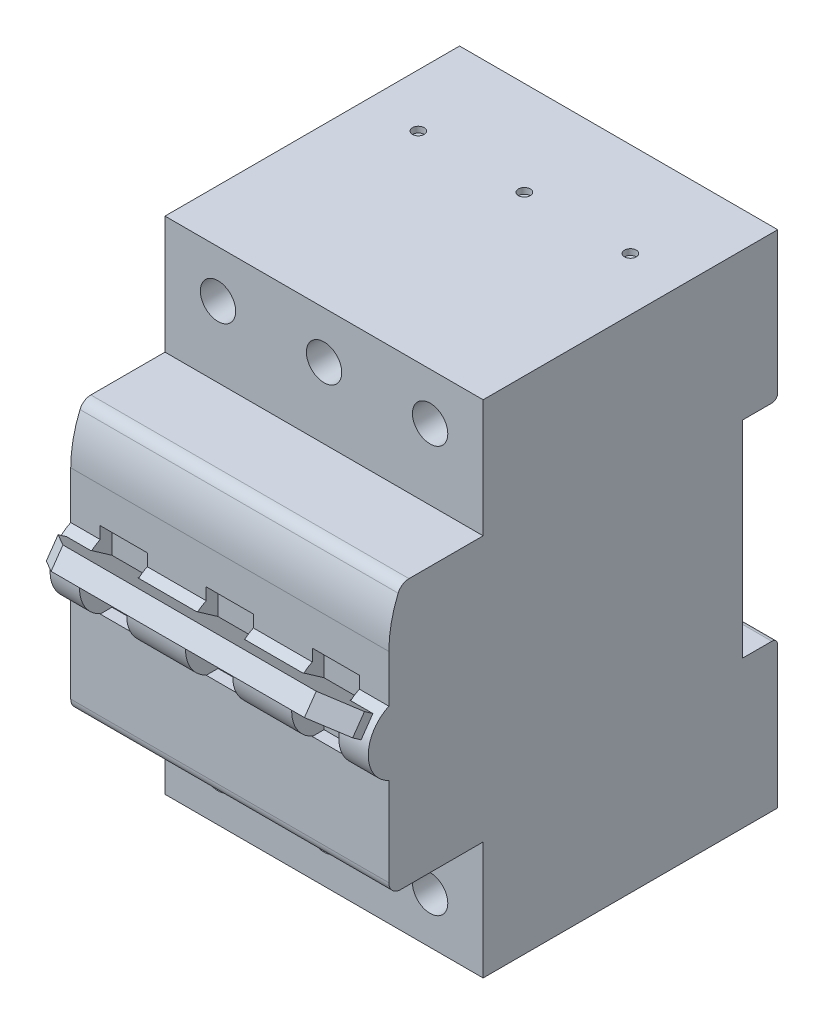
ISO-10303-21;
HEADER;
FILE_DESCRIPTION(('STEP AP214'),'2;1');
FILE_NAME('part.step','',(''),(''),'','','');
FILE_SCHEMA(('AUTOMOTIVE_DESIGN { 1 0 10303 214 1 1 1 1 }'));
ENDSEC;
DATA;
#1=APPLICATION_CONTEXT('core data for automotive mechanical design processes');
#2=APPLICATION_PROTOCOL_DEFINITION('international standard','automotive_design',2000,#1);
#3=PRODUCT_CONTEXT('',#1,'mechanical');
#4=PRODUCT('Part','Part','',(#3));
#5=PRODUCT_RELATED_PRODUCT_CATEGORY('part','',(#4));
#6=PRODUCT_DEFINITION_FORMATION('','',#4);
#7=PRODUCT_DEFINITION_CONTEXT('part definition',#1,'design');
#8=PRODUCT_DEFINITION('design','',#6,#7);
#9=PRODUCT_DEFINITION_SHAPE('','',#8);
#10=(LENGTH_UNIT() NAMED_UNIT(*) SI_UNIT(.MILLI.,.METRE.));
#11=(NAMED_UNIT(*) PLANE_ANGLE_UNIT() SI_UNIT($,.RADIAN.));
#12=(NAMED_UNIT(*) SI_UNIT($,.STERADIAN.) SOLID_ANGLE_UNIT());
#13=UNCERTAINTY_MEASURE_WITH_UNIT(LENGTH_MEASURE(1.E-05),#10,'distance_accuracy_value','');
#14=(GEOMETRIC_REPRESENTATION_CONTEXT(3) GLOBAL_UNCERTAINTY_ASSIGNED_CONTEXT((#13)) GLOBAL_UNIT_ASSIGNED_CONTEXT((#10,
#11,#12)) REPRESENTATION_CONTEXT('',''));
#15=CARTESIAN_POINT('',(0.,0.,0.));
#16=DIRECTION('',(0.,0.,1.));
#17=DIRECTION('',(1.,0.,0.));
#18=AXIS2_PLACEMENT_3D('',#15,#16,#17);
#19=CARTESIAN_POINT('',(-13.,1.,63.));
#20=DIRECTION('',(-1.,0.,0.));
#21=DIRECTION('',(0.,0.,1.));
#22=AXIS2_PLACEMENT_3D('',#19,#20,#21);
#23=PLANE('',#22);
#24=DIRECTION('',(0.,-0.573576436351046,-0.819152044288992));
#25=VECTOR('',#24,1.);
#26=CARTESIAN_POINT('',(-13.,4.73158058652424,61.7063654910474));
#27=LINE('',#26,#25);
#28=CARTESIAN_POINT('',(-13.,4.53614796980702,61.4272587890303));
#29=VERTEX_POINT('',#28);
#30=CARTESIAN_POINT('',(-13.,2.13635553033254,58.));
#31=VERTEX_POINT('',#30);
#32=EDGE_CURVE('E462',#29,#31,#27,.T.);
#33=ORIENTED_EDGE('',*,*,#32,.T.);
#34=DIRECTION('',(0.,1.,0.));
#35=VECTOR('',#34,1.);
#36=CARTESIAN_POINT('',(-13.,1.,58.));
#37=LINE('',#36,#35);
#38=CARTESIAN_POINT('',(-13.,7.5,58.));
#39=VERTEX_POINT('',#38);
#40=EDGE_CURVE('E736',#31,#39,#37,.T.);
#41=ORIENTED_EDGE('',*,*,#40,.T.);
#42=DIRECTION('',(0.,0.,1.));
#43=VECTOR('',#42,1.);
#44=CARTESIAN_POINT('',(-13.,7.5,63.));
#45=LINE('',#44,#43);
#46=CARTESIAN_POINT('',(-13.,7.5,60.));
#47=VERTEX_POINT('',#46);
#48=EDGE_CURVE('E732',#39,#47,#45,.T.);
#49=ORIENTED_EDGE('',*,*,#48,.T.);
#50=DIRECTION('',(0.,-1.,0.));
#51=VECTOR('',#50,1.);
#52=CARTESIAN_POINT('',(-13.,13.5,60.));
#53=LINE('',#52,#51);
#54=CARTESIAN_POINT('',(-13.,5.45435605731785,60.));
#55=VERTEX_POINT('',#54);
#56=EDGE_CURVE('E969',#47,#55,#53,.T.);
#57=ORIENTED_EDGE('',*,*,#56,.T.);
#58=CARTESIAN_POINT('',(-13.,0.,57.5));
#59=DIRECTION('',(-1.,0.,0.));
#60=DIRECTION('',(0.,0.,1.));
#61=AXIS2_PLACEMENT_3D('',#58,#59,#60);
#62=CIRCLE('',#61,6.);
#63=EDGE_CURVE('E33',#29,#55,#62,.T.);
#64=ORIENTED_EDGE('',*,*,#63,.F.);
#65=EDGE_LOOP('',(#33,#41,#49,#57,#64));
#66=FACE_BOUND('',#65,.T.);
#67=ADVANCED_FACE('F15',(#66),#23,.F.);
#68=CARTESIAN_POINT('',(-5.,1.,58.));
#69=DIRECTION('',(0.,0.,-1.));
#70=DIRECTION('',(-1.,0.,0.));
#71=AXIS2_PLACEMENT_3D('',#68,#69,#70);
#72=PLANE('',#71);
#73=DIRECTION('',(-1.,0.,0.));
#74=VECTOR('',#73,1.);
#75=CARTESIAN_POINT('',(-5.,2.13635553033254,58.));
#76=LINE('',#75,#74);
#77=CARTESIAN_POINT('',(-5.,2.13635553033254,58.));
#78=VERTEX_POINT('',#77);
#79=EDGE_CURVE('E590',#78,#31,#76,.T.);
#80=ORIENTED_EDGE('',*,*,#79,.F.);
#81=DIRECTION('',(0.,-1.,0.));
#82=VECTOR('',#81,1.);
#83=CARTESIAN_POINT('',(-5.,1.,58.));
#84=LINE('',#83,#82);
#85=CARTESIAN_POINT('',(-5.,7.5,58.));
#86=VERTEX_POINT('',#85);
#87=EDGE_CURVE('E722',#86,#78,#84,.T.);
#88=ORIENTED_EDGE('',*,*,#87,.F.);
#89=DIRECTION('',(-1.,0.,0.));
#90=VECTOR('',#89,1.);
#91=CARTESIAN_POINT('',(-5.,7.5,58.));
#92=LINE('',#91,#90);
#93=EDGE_CURVE('E721',#86,#39,#92,.T.);
#94=ORIENTED_EDGE('',*,*,#93,.T.);
#95=ORIENTED_EDGE('',*,*,#40,.F.);
#96=EDGE_LOOP('',(#80,#88,#94,#95));
#97=FACE_BOUND('',#96,.T.);
#98=ADVANCED_FACE('F1120',(#97),#72,.F.);
#99=CARTESIAN_POINT('',(-5.,1.,63.));
#100=DIRECTION('',(1.,0.,0.));
#101=DIRECTION('',(0.,0.,-1.));
#102=AXIS2_PLACEMENT_3D('',#99,#100,#101);
#103=PLANE('',#102);
#104=DIRECTION('',(0.,-0.573576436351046,-0.819152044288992));
#105=VECTOR('',#104,1.);
#106=CARTESIAN_POINT('',(-5.,4.73158058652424,61.7063654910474));
#107=LINE('',#106,#105);
#108=CARTESIAN_POINT('',(-5.,4.53614796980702,61.4272587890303));
#109=VERTEX_POINT('',#108);
#110=EDGE_CURVE('E457',#109,#78,#107,.T.);
#111=ORIENTED_EDGE('',*,*,#110,.F.);
#112=CARTESIAN_POINT('',(-5.,0.,57.5));
#113=DIRECTION('',(1.,0.,0.));
#114=DIRECTION('',(0.,0.,-1.));
#115=AXIS2_PLACEMENT_3D('',#112,#113,#114);
#116=CIRCLE('',#115,6.);
#117=CARTESIAN_POINT('',(-5.,5.45435605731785,60.));
#118=VERTEX_POINT('',#117);
#119=EDGE_CURVE('E744',#118,#109,#116,.T.);
#120=ORIENTED_EDGE('',*,*,#119,.F.);
#121=DIRECTION('',(0.,1.,0.));
#122=VECTOR('',#121,1.);
#123=CARTESIAN_POINT('',(-5.,13.5,60.));
#124=LINE('',#123,#122);
#125=CARTESIAN_POINT('',(-5.,7.5,60.));
#126=VERTEX_POINT('',#125);
#127=EDGE_CURVE('E896',#118,#126,#124,.T.);
#128=ORIENTED_EDGE('',*,*,#127,.T.);
#129=DIRECTION('',(0.,0.,-1.));
#130=VECTOR('',#129,1.);
#131=CARTESIAN_POINT('',(-5.,7.5,63.));
#132=LINE('',#131,#130);
#133=EDGE_CURVE('E718',#126,#86,#132,.T.);
#134=ORIENTED_EDGE('',*,*,#133,.T.);
#135=ORIENTED_EDGE('',*,*,#87,.T.);
#136=EDGE_LOOP('',(#111,#120,#128,#134,#135));
#137=FACE_BOUND('',#136,.T.);
#138=ADVANCED_FACE('F1126',(#137),#103,.F.);
#139=CARTESIAN_POINT('',(-31.,1.,63.));
#140=DIRECTION('',(-1.,0.,0.));
#141=DIRECTION('',(0.,0.,1.));
#142=AXIS2_PLACEMENT_3D('',#139,#140,#141);
#143=PLANE('',#142);
#144=DIRECTION('',(0.,-0.573576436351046,-0.819152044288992));
#145=VECTOR('',#144,1.);
#146=CARTESIAN_POINT('',(-31.,4.73158058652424,61.7063654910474));
#147=LINE('',#146,#145);
#148=CARTESIAN_POINT('',(-31.,4.53614796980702,61.4272587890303));
#149=VERTEX_POINT('',#148);
#150=CARTESIAN_POINT('',(-31.,2.13635553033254,58.));
#151=VERTEX_POINT('',#150);
#152=EDGE_CURVE('E475',#149,#151,#147,.T.);
#153=ORIENTED_EDGE('',*,*,#152,.T.);
#154=DIRECTION('',(0.,1.,0.));
#155=VECTOR('',#154,1.);
#156=CARTESIAN_POINT('',(-31.,1.,58.));
#157=LINE('',#156,#155);
#158=CARTESIAN_POINT('',(-31.,7.5,58.));
#159=VERTEX_POINT('',#158);
#160=EDGE_CURVE('E687',#151,#159,#157,.T.);
#161=ORIENTED_EDGE('',*,*,#160,.T.);
#162=DIRECTION('',(0.,0.,1.));
#163=VECTOR('',#162,1.);
#164=CARTESIAN_POINT('',(-31.,7.5,63.));
#165=LINE('',#164,#163);
#166=CARTESIAN_POINT('',(-31.,7.5,60.));
#167=VERTEX_POINT('',#166);
#168=EDGE_CURVE('E683',#159,#167,#165,.T.);
#169=ORIENTED_EDGE('',*,*,#168,.T.);
#170=DIRECTION('',(0.,-1.,0.));
#171=VECTOR('',#170,1.);
#172=CARTESIAN_POINT('',(-31.,13.5,60.));
#173=LINE('',#172,#171);
#174=CARTESIAN_POINT('',(-31.,5.45435605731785,60.));
#175=VERTEX_POINT('',#174);
#176=EDGE_CURVE('E981',#167,#175,#173,.T.);
#177=ORIENTED_EDGE('',*,*,#176,.T.);
#178=CARTESIAN_POINT('',(-31.,0.,57.5));
#179=DIRECTION('',(-1.,0.,0.));
#180=DIRECTION('',(0.,0.,1.));
#181=AXIS2_PLACEMENT_3D('',#178,#179,#180);
#182=CIRCLE('',#181,6.);
#183=EDGE_CURVE('E705',#149,#175,#182,.T.);
#184=ORIENTED_EDGE('',*,*,#183,.F.);
#185=EDGE_LOOP('',(#153,#161,#169,#177,#184));
#186=FACE_BOUND('',#185,.T.);
#187=ADVANCED_FACE('F1203',(#186),#143,.F.);
#188=CARTESIAN_POINT('',(-23.,1.,58.));
#189=DIRECTION('',(0.,0.,-1.));
#190=DIRECTION('',(-1.,0.,0.));
#191=AXIS2_PLACEMENT_3D('',#188,#189,#190);
#192=PLANE('',#191);
#193=DIRECTION('',(-1.,0.,0.));
#194=VECTOR('',#193,1.);
#195=CARTESIAN_POINT('',(-23.,2.13635553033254,58.));
#196=LINE('',#195,#194);
#197=CARTESIAN_POINT('',(-23.,2.13635553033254,58.));
#198=VERTEX_POINT('',#197);
#199=EDGE_CURVE('E586',#198,#151,#196,.T.);
#200=ORIENTED_EDGE('',*,*,#199,.F.);
#201=DIRECTION('',(0.,-1.,0.));
#202=VECTOR('',#201,1.);
#203=CARTESIAN_POINT('',(-23.,1.,58.));
#204=LINE('',#203,#202);
#205=CARTESIAN_POINT('',(-23.,7.5,58.));
#206=VERTEX_POINT('',#205);
#207=EDGE_CURVE('E673',#206,#198,#204,.T.);
#208=ORIENTED_EDGE('',*,*,#207,.F.);
#209=DIRECTION('',(-1.,0.,0.));
#210=VECTOR('',#209,1.);
#211=CARTESIAN_POINT('',(-23.,7.5,58.));
#212=LINE('',#211,#210);
#213=EDGE_CURVE('E672',#206,#159,#212,.T.);
#214=ORIENTED_EDGE('',*,*,#213,.T.);
#215=ORIENTED_EDGE('',*,*,#160,.F.);
#216=EDGE_LOOP('',(#200,#208,#214,#215));
#217=FACE_BOUND('',#216,.T.);
#218=ADVANCED_FACE('F1230',(#217),#192,.F.);
#219=CARTESIAN_POINT('',(-23.,1.,63.));
#220=DIRECTION('',(1.,0.,0.));
#221=DIRECTION('',(0.,0.,-1.));
#222=AXIS2_PLACEMENT_3D('',#219,#220,#221);
#223=PLANE('',#222);
#224=DIRECTION('',(0.,-0.573576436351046,-0.819152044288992));
#225=VECTOR('',#224,1.);
#226=CARTESIAN_POINT('',(-23.,4.73158058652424,61.7063654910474));
#227=LINE('',#226,#225);
#228=CARTESIAN_POINT('',(-23.,4.53614796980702,61.4272587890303));
#229=VERTEX_POINT('',#228);
#230=EDGE_CURVE('E470',#229,#198,#227,.T.);
#231=ORIENTED_EDGE('',*,*,#230,.F.);
#232=CARTESIAN_POINT('',(-23.,0.,57.5));
#233=DIRECTION('',(1.,0.,0.));
#234=DIRECTION('',(0.,0.,-1.));
#235=AXIS2_PLACEMENT_3D('',#232,#233,#234);
#236=CIRCLE('',#235,6.);
#237=CARTESIAN_POINT('',(-23.,5.45435605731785,60.));
#238=VERTEX_POINT('',#237);
#239=EDGE_CURVE('E696',#238,#229,#236,.T.);
#240=ORIENTED_EDGE('',*,*,#239,.F.);
#241=DIRECTION('',(0.,1.,0.));
#242=VECTOR('',#241,1.);
#243=CARTESIAN_POINT('',(-23.,13.5,60.));
#244=LINE('',#243,#242);
#245=CARTESIAN_POINT('',(-23.,7.5,60.));
#246=VERTEX_POINT('',#245);
#247=EDGE_CURVE('E975',#238,#246,#244,.T.);
#248=ORIENTED_EDGE('',*,*,#247,.T.);
#249=DIRECTION('',(0.,0.,-1.));
#250=VECTOR('',#249,1.);
#251=CARTESIAN_POINT('',(-23.,7.5,63.));
#252=LINE('',#251,#250);
#253=EDGE_CURVE('E669',#246,#206,#252,.T.);
#254=ORIENTED_EDGE('',*,*,#253,.T.);
#255=ORIENTED_EDGE('',*,*,#207,.T.);
#256=EDGE_LOOP('',(#231,#240,#248,#254,#255));
#257=FACE_BOUND('',#256,.T.);
#258=ADVANCED_FACE('F1252',(#257),#223,.F.);
#259=CARTESIAN_POINT('',(-49.,1.,63.));
#260=DIRECTION('',(-1.,0.,0.));
#261=DIRECTION('',(0.,0.,1.));
#262=AXIS2_PLACEMENT_3D('',#259,#260,#261);
#263=PLANE('',#262);
#264=DIRECTION('',(0.,-0.573576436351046,-0.819152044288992));
#265=VECTOR('',#264,1.);
#266=CARTESIAN_POINT('',(-49.,4.73158058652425,61.7063654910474));
#267=LINE('',#266,#265);
#268=CARTESIAN_POINT('',(-49.,4.53614796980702,61.4272587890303));
#269=VERTEX_POINT('',#268);
#270=CARTESIAN_POINT('',(-49.,2.13635553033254,58.));
#271=VERTEX_POINT('',#270);
#272=EDGE_CURVE('E487',#269,#271,#267,.T.);
#273=ORIENTED_EDGE('',*,*,#272,.T.);
#274=DIRECTION('',(0.,1.,0.));
#275=VECTOR('',#274,1.);
#276=CARTESIAN_POINT('',(-49.,1.,58.));
#277=LINE('',#276,#275);
#278=CARTESIAN_POINT('',(-49.,7.5,58.));
#279=VERTEX_POINT('',#278);
#280=EDGE_CURVE('E638',#271,#279,#277,.T.);
#281=ORIENTED_EDGE('',*,*,#280,.T.);
#282=DIRECTION('',(0.,0.,1.));
#283=VECTOR('',#282,1.);
#284=CARTESIAN_POINT('',(-49.,7.5,63.));
#285=LINE('',#284,#283);
#286=CARTESIAN_POINT('',(-49.,7.5,60.));
#287=VERTEX_POINT('',#286);
#288=EDGE_CURVE('E634',#279,#287,#285,.T.);
#289=ORIENTED_EDGE('',*,*,#288,.T.);
#290=DIRECTION('',(0.,-1.,0.));
#291=VECTOR('',#290,1.);
#292=CARTESIAN_POINT('',(-49.,13.5,60.));
#293=LINE('',#292,#291);
#294=CARTESIAN_POINT('',(-49.,5.45435605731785,60.));
#295=VERTEX_POINT('',#294);
#296=EDGE_CURVE('E994',#287,#295,#293,.T.);
#297=ORIENTED_EDGE('',*,*,#296,.T.);
#298=CARTESIAN_POINT('',(-49.,0.,57.5));
#299=DIRECTION('',(-1.,0.,0.));
#300=DIRECTION('',(0.,0.,1.));
#301=AXIS2_PLACEMENT_3D('',#298,#299,#300);
#302=CIRCLE('',#301,6.);
#303=EDGE_CURVE('E656',#269,#295,#302,.T.);
#304=ORIENTED_EDGE('',*,*,#303,.F.);
#305=EDGE_LOOP('',(#273,#281,#289,#297,#304));
#306=FACE_BOUND('',#305,.T.);
#307=ADVANCED_FACE('F1263',(#306),#263,.F.);
#308=CARTESIAN_POINT('',(-41.,1.,58.));
#309=DIRECTION('',(0.,0.,-1.));
#310=DIRECTION('',(-1.,0.,0.));
#311=AXIS2_PLACEMENT_3D('',#308,#309,#310);
#312=PLANE('',#311);
#313=DIRECTION('',(-1.,0.,0.));
#314=VECTOR('',#313,1.);
#315=CARTESIAN_POINT('',(-41.,2.13635553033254,58.));
#316=LINE('',#315,#314);
#317=CARTESIAN_POINT('',(-41.,2.13635553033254,58.));
#318=VERTEX_POINT('',#317);
#319=EDGE_CURVE('E549',#318,#271,#316,.T.);
#320=ORIENTED_EDGE('',*,*,#319,.F.);
#321=DIRECTION('',(0.,-1.,0.));
#322=VECTOR('',#321,1.);
#323=CARTESIAN_POINT('',(-41.,1.,58.));
#324=LINE('',#323,#322);
#325=CARTESIAN_POINT('',(-41.,7.5,58.));
#326=VERTEX_POINT('',#325);
#327=EDGE_CURVE('E624',#326,#318,#324,.T.);
#328=ORIENTED_EDGE('',*,*,#327,.F.);
#329=DIRECTION('',(-1.,0.,0.));
#330=VECTOR('',#329,1.);
#331=CARTESIAN_POINT('',(-41.,7.5,58.));
#332=LINE('',#331,#330);
#333=EDGE_CURVE('E623',#326,#279,#332,.T.);
#334=ORIENTED_EDGE('',*,*,#333,.T.);
#335=ORIENTED_EDGE('',*,*,#280,.F.);
#336=EDGE_LOOP('',(#320,#328,#334,#335));
#337=FACE_BOUND('',#336,.T.);
#338=ADVANCED_FACE('F1290',(#337),#312,.F.);
#339=CARTESIAN_POINT('',(-41.,1.,63.));
#340=DIRECTION('',(1.,0.,0.));
#341=DIRECTION('',(0.,0.,-1.));
#342=AXIS2_PLACEMENT_3D('',#339,#340,#341);
#343=PLANE('',#342);
#344=DIRECTION('',(0.,-0.573576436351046,-0.819152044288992));
#345=VECTOR('',#344,1.);
#346=CARTESIAN_POINT('',(-41.,4.11173755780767,60.8211379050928));
#347=LINE('',#346,#345);
#348=CARTESIAN_POINT('',(-41.,4.53614796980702,61.4272587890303));
#349=VERTEX_POINT('',#348);
#350=EDGE_CURVE('E25',#349,#318,#347,.T.);
#351=ORIENTED_EDGE('',*,*,#350,.F.);
#352=CARTESIAN_POINT('',(-41.,0.,57.5));
#353=DIRECTION('',(1.,0.,0.));
#354=DIRECTION('',(0.,0.,-1.));
#355=AXIS2_PLACEMENT_3D('',#352,#353,#354);
#356=CIRCLE('',#355,6.);
#357=CARTESIAN_POINT('',(-41.,5.45435605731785,60.));
#358=VERTEX_POINT('',#357);
#359=EDGE_CURVE('E647',#358,#349,#356,.T.);
#360=ORIENTED_EDGE('',*,*,#359,.F.);
#361=DIRECTION('',(0.,1.,0.));
#362=VECTOR('',#361,1.);
#363=CARTESIAN_POINT('',(-41.,13.5,60.));
#364=LINE('',#363,#362);
#365=CARTESIAN_POINT('',(-41.,7.5,60.));
#366=VERTEX_POINT('',#365);
#367=EDGE_CURVE('E988',#358,#366,#364,.T.);
#368=ORIENTED_EDGE('',*,*,#367,.T.);
#369=DIRECTION('',(0.,0.,-1.));
#370=VECTOR('',#369,1.);
#371=CARTESIAN_POINT('',(-41.,7.5,63.));
#372=LINE('',#371,#370);
#373=EDGE_CURVE('E620',#366,#326,#372,.T.);
#374=ORIENTED_EDGE('',*,*,#373,.T.);
#375=ORIENTED_EDGE('',*,*,#327,.T.);
#376=EDGE_LOOP('',(#351,#360,#368,#374,#375));
#377=FACE_BOUND('',#376,.T.);
#378=ADVANCED_FACE('F1311',(#377),#343,.F.);
#379=CARTESIAN_POINT('',(-54.,0.,57.5));
#380=DIRECTION('',(1.,0.,0.));
#381=DIRECTION('',(0.,0.,-1.));
#382=AXIS2_PLACEMENT_3D('',#379,#380,#381);
#383=CYLINDRICAL_SURFACE('',#382,6.);
#384=DIRECTION('',(1.,0.,0.));
#385=VECTOR('',#384,1.);
#386=CARTESIAN_POINT('',(-54.,-5.45435605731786,60.));
#387=LINE('',#386,#385);
#388=CARTESIAN_POINT('',(-54.,-5.45435605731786,60.));
#389=VERTEX_POINT('',#388);
#390=CARTESIAN_POINT('',(-49.,-5.45435605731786,60.));
#391=VERTEX_POINT('',#390);
#392=EDGE_CURVE('E918',#389,#391,#387,.T.);
#393=ORIENTED_EDGE('',*,*,#392,.T.);
#394=CARTESIAN_POINT('',(-49.,1.56866142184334,63.2913125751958));
#395=VERTEX_POINT('',#394);
#396=EDGE_CURVE('E657',#391,#395,#302,.T.);
#397=ORIENTED_EDGE('',*,*,#396,.T.);
#398=CARTESIAN_POINT('',(-49.,0.,57.5));
#399=DIRECTION('',(1.,0.,0.));
#400=DIRECTION('',(0.,1.,0.));
#401=AXIS2_PLACEMENT_3D('',#398,#399,#400);
#402=CIRCLE('',#401,6.);
#403=EDGE_CURVE('E603',#269,#395,#402,.T.);
#404=ORIENTED_EDGE('',*,*,#403,.F.);
#405=ORIENTED_EDGE('',*,*,#303,.T.);
#406=DIRECTION('',(1.,0.,0.));
#407=VECTOR('',#406,1.);
#408=CARTESIAN_POINT('',(-54.,5.45435605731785,60.));
#409=LINE('',#408,#407);
#410=CARTESIAN_POINT('',(-54.,5.45435605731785,60.));
#411=VERTEX_POINT('',#410);
#412=EDGE_CURVE('E924',#411,#295,#409,.T.);
#413=ORIENTED_EDGE('',*,*,#412,.F.);
#414=CARTESIAN_POINT('',(-54.,0.,57.5));
#415=DIRECTION('',(-1.,0.,0.));
#416=DIRECTION('',(0.,0.,1.));
#417=AXIS2_PLACEMENT_3D('',#414,#415,#416);
#418=CIRCLE('',#417,6.);
#419=EDGE_CURVE('E863',#389,#411,#418,.T.);
#420=ORIENTED_EDGE('',*,*,#419,.F.);
#421=EDGE_LOOP('',(#393,#397,#404,#405,#413,#420));
#422=FACE_BOUND('',#421,.T.);
#423=ADVANCED_FACE('F1825',(#422),#383,.T.);
#424=EDGE_CURVE('E928',#358,#175,#409,.T.);
#425=ORIENTED_EDGE('',*,*,#424,.F.);
#426=ORIENTED_EDGE('',*,*,#359,.T.);
#427=CARTESIAN_POINT('',(-41.,1.56866142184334,63.2913125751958));
#428=VERTEX_POINT('',#427);
#429=EDGE_CURVE('E652',#349,#428,#356,.T.);
#430=ORIENTED_EDGE('',*,*,#429,.T.);
#431=CARTESIAN_POINT('',(-41.,-5.45435605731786,60.));
#432=VERTEX_POINT('',#431);
#433=EDGE_CURVE('E646',#428,#432,#356,.T.);
#434=ORIENTED_EDGE('',*,*,#433,.T.);
#435=CARTESIAN_POINT('',(-31.,-5.45435605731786,60.));
#436=VERTEX_POINT('',#435);
#437=EDGE_CURVE('E922',#432,#436,#387,.T.);
#438=ORIENTED_EDGE('',*,*,#437,.T.);
#439=CARTESIAN_POINT('',(-31.,1.56866142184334,63.2913125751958));
#440=VERTEX_POINT('',#439);
#441=EDGE_CURVE('E706',#436,#440,#182,.T.);
#442=ORIENTED_EDGE('',*,*,#441,.T.);
#443=CARTESIAN_POINT('',(-31.,0.,57.5));
#444=DIRECTION('',(1.,0.,0.));
#445=DIRECTION('',(0.,1.,0.));
#446=AXIS2_PLACEMENT_3D('',#443,#444,#445);
#447=CIRCLE('',#446,6.);
#448=EDGE_CURVE('E607',#149,#440,#447,.T.);
#449=ORIENTED_EDGE('',*,*,#448,.F.);
#450=ORIENTED_EDGE('',*,*,#183,.T.);
#451=EDGE_LOOP('',(#425,#426,#430,#434,#438,#442,#449,#450));
#452=FACE_BOUND('',#451,.T.);
#453=ADVANCED_FACE('F1837',(#452),#383,.T.);
#454=EDGE_CURVE('E1861',#238,#55,#409,.T.);
#455=ORIENTED_EDGE('',*,*,#454,.F.);
#456=ORIENTED_EDGE('',*,*,#239,.T.);
#457=CARTESIAN_POINT('',(-23.,1.56866142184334,63.2913125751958));
#458=VERTEX_POINT('',#457);
#459=EDGE_CURVE('E701',#229,#458,#236,.T.);
#460=ORIENTED_EDGE('',*,*,#459,.T.);
#461=CARTESIAN_POINT('',(-23.,-5.45435605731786,60.));
#462=VERTEX_POINT('',#461);
#463=EDGE_CURVE('E695',#458,#462,#236,.T.);
#464=ORIENTED_EDGE('',*,*,#463,.T.);
#465=CARTESIAN_POINT('',(-13.,-5.45435605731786,60.));
#466=VERTEX_POINT('',#465);
#467=EDGE_CURVE('E1868',#462,#466,#387,.T.);
#468=ORIENTED_EDGE('',*,*,#467,.T.);
#469=CARTESIAN_POINT('',(-13.,1.56866142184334,63.2913125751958));
#470=VERTEX_POINT('',#469);
#471=EDGE_CURVE('E753',#466,#470,#62,.T.);
#472=ORIENTED_EDGE('',*,*,#471,.T.);
#473=CARTESIAN_POINT('',(-13.,0.,57.5));
#474=DIRECTION('',(1.,0.,0.));
#475=DIRECTION('',(0.,1.,0.));
#476=AXIS2_PLACEMENT_3D('',#473,#474,#475);
#477=CIRCLE('',#476,6.);
#478=EDGE_CURVE('E611',#29,#470,#477,.T.);
#479=ORIENTED_EDGE('',*,*,#478,.F.);
#480=ORIENTED_EDGE('',*,*,#63,.T.);
#481=EDGE_LOOP('',(#455,#456,#460,#464,#468,#472,#479,#480));
#482=FACE_BOUND('',#481,.T.);
#483=ADVANCED_FACE('F1853',(#482),#383,.T.);
#484=CARTESIAN_POINT('',(-54.,-17.5,0.));
#485=DIRECTION('',(0.,-1.,0.));
#486=DIRECTION('',(0.,0.,1.));
#487=AXIS2_PLACEMENT_3D('',#484,#485,#486);
#488=PLANE('',#487);
#489=DIRECTION('',(0.,0.,-1.));
#490=VECTOR('',#489,1.);
#491=CARTESIAN_POINT('',(0.,-17.5,0.));
#492=LINE('',#491,#490);
#493=CARTESIAN_POINT('',(0.,-17.5,0.));
#494=VERTEX_POINT('',#493);
#495=CARTESIAN_POINT('',(0.,-17.5,-5.));
#496=VERTEX_POINT('',#495);
#497=EDGE_CURVE('E759',#494,#496,#492,.T.);
#498=ORIENTED_EDGE('',*,*,#497,.T.);
#499=DIRECTION('',(1.,0.,0.));
#500=VECTOR('',#499,1.);
#501=CARTESIAN_POINT('',(-54.,-17.5,-5.));
#502=LINE('',#501,#500);
#503=CARTESIAN_POINT('',(-54.,-17.5,-5.));
#504=VERTEX_POINT('',#503);
#505=EDGE_CURVE('E892',#504,#496,#502,.T.);
#506=ORIENTED_EDGE('',*,*,#505,.F.);
#507=DIRECTION('',(0.,0.,-1.));
#508=VECTOR('',#507,1.);
#509=CARTESIAN_POINT('',(-54.,-17.5,0.));
#510=LINE('',#509,#508);
#511=CARTESIAN_POINT('',(-54.,-17.5,0.));
#512=VERTEX_POINT('',#511);
#513=EDGE_CURVE('E763',#512,#504,#510,.T.);
#514=ORIENTED_EDGE('',*,*,#513,.F.);
#515=DIRECTION('',(1.,0.,0.));
#516=VECTOR('',#515,1.);
#517=CARTESIAN_POINT('',(-54.,-17.5,0.));
#518=LINE('',#517,#516);
#519=EDGE_CURVE('E831',#512,#494,#518,.T.);
#520=ORIENTED_EDGE('',*,*,#519,.T.);
#521=EDGE_LOOP('',(#498,#506,#514,#520));
#522=FACE_BOUND('',#521,.T.);
#523=ADVANCED_FACE('F17',(#522),#488,.F.);
#524=CARTESIAN_POINT('',(-54.,-18.5,-5.));
#525=DIRECTION('',(1.,0.,0.));
#526=DIRECTION('',(0.,0.,-1.));
#527=AXIS2_PLACEMENT_3D('',#524,#525,#526);
#528=CYLINDRICAL_SURFACE('',#527,1.);
#529=CARTESIAN_POINT('',(0.,-18.5,-5.));
#530=DIRECTION('',(-1.,0.,0.));
#531=DIRECTION('',(0.,0.,1.));
#532=AXIS2_PLACEMENT_3D('',#529,#530,#531);
#533=CIRCLE('',#532,1.);
#534=CARTESIAN_POINT('',(0.,-18.5,-6.));
#535=VERTEX_POINT('',#534);
#536=EDGE_CURVE('E822',#496,#535,#533,.T.);
#537=ORIENTED_EDGE('',*,*,#536,.T.);
#538=DIRECTION('',(1.,0.,0.));
#539=VECTOR('',#538,1.);
#540=CARTESIAN_POINT('',(-54.,-18.5,-6.));
#541=LINE('',#540,#539);
#542=CARTESIAN_POINT('',(-54.,-18.5,-6.));
#543=VERTEX_POINT('',#542);
#544=EDGE_CURVE('E897',#543,#535,#541,.T.);
#545=ORIENTED_EDGE('',*,*,#544,.F.);
#546=CARTESIAN_POINT('',(-54.,-18.5,-5.));
#547=DIRECTION('',(-1.,0.,0.));
#548=DIRECTION('',(0.,0.,1.));
#549=AXIS2_PLACEMENT_3D('',#546,#547,#548);
#550=CIRCLE('',#549,1.);
#551=EDGE_CURVE('E886',#504,#543,#550,.T.);
#552=ORIENTED_EDGE('',*,*,#551,.F.);
#553=ORIENTED_EDGE('',*,*,#505,.T.);
#554=EDGE_LOOP('',(#537,#545,#552,#553));
#555=FACE_BOUND('',#554,.T.);
#556=ADVANCED_FACE('F1893',(#555),#528,.T.);
#557=CARTESIAN_POINT('',(-54.,-18.5,-6.));
#558=DIRECTION('',(0.,0.,1.));
#559=DIRECTION('',(1.,0.,0.));
#560=AXIS2_PLACEMENT_3D('',#557,#558,#559);
#561=PLANE('',#560);
#562=DIRECTION('',(0.,-1.,0.));
#563=VECTOR('',#562,1.);
#564=CARTESIAN_POINT('',(0.,-18.5,-6.));
#565=LINE('',#564,#563);
#566=CARTESIAN_POINT('',(0.,-42.5,-6.));
#567=VERTEX_POINT('',#566);
#568=EDGE_CURVE('E819',#535,#567,#565,.T.);
#569=ORIENTED_EDGE('',*,*,#568,.T.);
#570=DIRECTION('',(1.,0.,0.));
#571=VECTOR('',#570,1.);
#572=CARTESIAN_POINT('',(-54.,-42.5,-6.));
#573=LINE('',#572,#571);
#574=CARTESIAN_POINT('',(-54.,-42.5,-6.));
#575=VERTEX_POINT('',#574);
#576=EDGE_CURVE('E901',#575,#567,#573,.T.);
#577=ORIENTED_EDGE('',*,*,#576,.F.);
#578=DIRECTION('',(0.,-1.,0.));
#579=VECTOR('',#578,1.);
#580=CARTESIAN_POINT('',(-54.,-18.5,-6.));
#581=LINE('',#580,#579);
#582=EDGE_CURVE('E883',#543,#575,#581,.T.);
#583=ORIENTED_EDGE('',*,*,#582,.F.);
#584=ORIENTED_EDGE('',*,*,#544,.T.);
#585=EDGE_LOOP('',(#569,#577,#583,#584));
#586=FACE_BOUND('',#585,.T.);
#587=ADVANCED_FACE('F1905',(#586),#561,.F.);
#588=CARTESIAN_POINT('',(-54.,-42.5,-6.));
#589=DIRECTION('',(0.,1.,0.));
#590=DIRECTION('',(-1.,0.,0.));
#591=AXIS2_PLACEMENT_3D('',#588,#589,#590);
#592=PLANE('',#591);
#593=CARTESIAN_POINT('',(-45.,-42.5,10.));
#594=DIRECTION('',(0.,1.,0.));
#595=DIRECTION('',(0.,0.,1.));
#596=AXIS2_PLACEMENT_3D('',#593,#594,#595);
#597=CIRCLE('',#596,1.);
#598=CARTESIAN_POINT('',(-45.,-42.5,11.));
#599=VERTEX_POINT('',#598);
#600=EDGE_CURVE('E19',#599,#599,#597,.T.);
#601=ORIENTED_EDGE('',*,*,#600,.T.);
#602=EDGE_LOOP('',(#601));
#603=FACE_BOUND('',#602,.T.);
#604=CARTESIAN_POINT('',(-27.,-42.5,10.));
#605=DIRECTION('',(0.,1.,0.));
#606=DIRECTION('',(0.,0.,1.));
#607=AXIS2_PLACEMENT_3D('',#604,#605,#606);
#608=CIRCLE('',#607,1.);
#609=CARTESIAN_POINT('',(-27.,-42.5,11.));
#610=VERTEX_POINT('',#609);
#611=EDGE_CURVE('E1047',#610,#610,#608,.T.);
#612=ORIENTED_EDGE('',*,*,#611,.T.);
#613=EDGE_LOOP('',(#612));
#614=FACE_BOUND('',#613,.T.);
#615=CARTESIAN_POINT('',(-9.,-42.5,10.));
#616=DIRECTION('',(0.,1.,0.));
#617=DIRECTION('',(0.,0.,1.));
#618=AXIS2_PLACEMENT_3D('',#615,#616,#617);
#619=CIRCLE('',#618,1.);
#620=CARTESIAN_POINT('',(-9.,-42.5,11.));
#621=VERTEX_POINT('',#620);
#622=EDGE_CURVE('E1042',#621,#621,#619,.T.);
#623=ORIENTED_EDGE('',*,*,#622,.T.);
#624=EDGE_LOOP('',(#623));
#625=FACE_BOUND('',#624,.T.);
#626=DIRECTION('',(0.,0.,1.));
#627=VECTOR('',#626,1.);
#628=CARTESIAN_POINT('',(0.,-42.5,-6.));
#629=LINE('',#628,#627);
#630=CARTESIAN_POINT('',(0.,-42.5,44.));
#631=VERTEX_POINT('',#630);
#632=EDGE_CURVE('E815',#567,#631,#629,.T.);
#633=ORIENTED_EDGE('',*,*,#632,.T.);
#634=DIRECTION('',(1.,0.,0.));
#635=VECTOR('',#634,1.);
#636=CARTESIAN_POINT('',(-54.,-42.5,44.));
#637=LINE('',#636,#635);
#638=CARTESIAN_POINT('',(-54.,-42.5,44.));
#639=VERTEX_POINT('',#638);
#640=EDGE_CURVE('E905',#639,#631,#637,.T.);
#641=ORIENTED_EDGE('',*,*,#640,.F.);
#642=DIRECTION('',(0.,0.,1.));
#643=VECTOR('',#642,1.);
#644=CARTESIAN_POINT('',(-54.,-42.5,-6.));
#645=LINE('',#644,#643);
#646=EDGE_CURVE('E880',#575,#639,#645,.T.);
#647=ORIENTED_EDGE('',*,*,#646,.F.);
#648=ORIENTED_EDGE('',*,*,#576,.T.);
#649=EDGE_LOOP('',(#633,#641,#647,#648));
#650=FACE_BOUND('',#649,.T.);
#651=ADVANCED_FACE('F1916',(#603,#614,#625,#650),#592,.F.);
#652=CARTESIAN_POINT('',(-54.,-22.5,44.));
#653=DIRECTION('',(0.,0.,1.));
#654=DIRECTION('',(1.,0.,0.));
#655=AXIS2_PLACEMENT_3D('',#652,#653,#654);
#656=PLANE('',#655);
#657=CARTESIAN_POINT('',(-45.,-34.5,44.));
#658=DIRECTION('',(0.,0.,1.));
#659=DIRECTION('',(1.,0.,0.));
#660=AXIS2_PLACEMENT_3D('',#657,#658,#659);
#661=CIRCLE('',#660,3.);
#662=CARTESIAN_POINT('',(-42.,-34.5,44.));
#663=VERTEX_POINT('',#662);
#664=EDGE_CURVE('E1027',#663,#663,#661,.T.);
#665=ORIENTED_EDGE('',*,*,#664,.F.);
#666=EDGE_LOOP('',(#665));
#667=FACE_BOUND('',#666,.T.);
#668=CARTESIAN_POINT('',(-27.,-34.5,44.));
#669=DIRECTION('',(0.,0.,1.));
#670=DIRECTION('',(1.,0.,0.));
#671=AXIS2_PLACEMENT_3D('',#668,#669,#670);
#672=CIRCLE('',#671,3.);
#673=CARTESIAN_POINT('',(-24.,-34.5,44.));
#674=VERTEX_POINT('',#673);
#675=EDGE_CURVE('E1022',#674,#674,#672,.T.);
#676=ORIENTED_EDGE('',*,*,#675,.F.);
#677=EDGE_LOOP('',(#676));
#678=FACE_BOUND('',#677,.T.);
#679=CARTESIAN_POINT('',(-9.,-34.5,44.));
#680=DIRECTION('',(0.,0.,1.));
#681=DIRECTION('',(1.,0.,0.));
#682=AXIS2_PLACEMENT_3D('',#679,#680,#681);
#683=CIRCLE('',#682,3.);
#684=CARTESIAN_POINT('',(-6.,-34.5,44.));
#685=VERTEX_POINT('',#684);
#686=EDGE_CURVE('E1017',#685,#685,#683,.T.);
#687=ORIENTED_EDGE('',*,*,#686,.F.);
#688=EDGE_LOOP('',(#687));
#689=FACE_BOUND('',#688,.T.);
#690=DIRECTION('',(0.,-1.,0.));
#691=VECTOR('',#690,1.);
#692=CARTESIAN_POINT('',(0.,-22.5,44.));
#693=LINE('',#692,#691);
#694=CARTESIAN_POINT('',(0.,-22.5,44.));
#695=VERTEX_POINT('',#694);
#696=EDGE_CURVE('E811',#695,#631,#693,.T.);
#697=ORIENTED_EDGE('',*,*,#696,.F.);
#698=DIRECTION('',(1.,0.,0.));
#699=VECTOR('',#698,1.);
#700=CARTESIAN_POINT('',(-54.,-22.5,44.));
#701=LINE('',#700,#699);
#702=CARTESIAN_POINT('',(-54.,-22.5,44.));
#703=VERTEX_POINT('',#702);
#704=EDGE_CURVE('E908',#703,#695,#701,.T.);
#705=ORIENTED_EDGE('',*,*,#704,.F.);
#706=DIRECTION('',(0.,-1.,0.));
#707=VECTOR('',#706,1.);
#708=CARTESIAN_POINT('',(-54.,-22.5,44.));
#709=LINE('',#708,#707);
#710=EDGE_CURVE('E876',#703,#639,#709,.T.);
#711=ORIENTED_EDGE('',*,*,#710,.T.);
#712=ORIENTED_EDGE('',*,*,#640,.T.);
#713=EDGE_LOOP('',(#697,#705,#711,#712));
#714=FACE_BOUND('',#713,.T.);
#715=ADVANCED_FACE('F1928',(#667,#678,#689,#714),#656,.T.);
#716=CARTESIAN_POINT('',(-54.,-22.5,44.));
#717=DIRECTION('',(0.,1.,0.));
#718=DIRECTION('',(0.,0.,-1.));
#719=AXIS2_PLACEMENT_3D('',#716,#717,#718);
#720=PLANE('',#719);
#721=DIRECTION('',(0.,0.,1.));
#722=VECTOR('',#721,1.);
#723=CARTESIAN_POINT('',(0.,-22.5,44.));
#724=LINE('',#723,#722);
#725=CARTESIAN_POINT('',(0.,-22.5,58.));
#726=VERTEX_POINT('',#725);
#727=EDGE_CURVE('E808',#695,#726,#724,.T.);
#728=ORIENTED_EDGE('',*,*,#727,.T.);
#729=DIRECTION('',(1.,0.,0.));
#730=VECTOR('',#729,1.);
#731=CARTESIAN_POINT('',(-54.,-22.5,58.));
#732=LINE('',#731,#730);
#733=CARTESIAN_POINT('',(-54.,-22.5,58.));
#734=VERTEX_POINT('',#733);
#735=EDGE_CURVE('E911',#734,#726,#732,.T.);
#736=ORIENTED_EDGE('',*,*,#735,.F.);
#737=DIRECTION('',(0.,0.,1.));
#738=VECTOR('',#737,1.);
#739=CARTESIAN_POINT('',(-54.,-22.5,44.));
#740=LINE('',#739,#738);
#741=EDGE_CURVE('E873',#703,#734,#740,.T.);
#742=ORIENTED_EDGE('',*,*,#741,.F.);
#743=ORIENTED_EDGE('',*,*,#704,.T.);
#744=EDGE_LOOP('',(#728,#736,#742,#743));
#745=FACE_BOUND('',#744,.T.);
#746=ADVANCED_FACE('F1943',(#745),#720,.F.);
#747=CARTESIAN_POINT('',(-54.,-20.5,58.));
#748=DIRECTION('',(1.,0.,0.));
#749=DIRECTION('',(0.,0.,-1.));
#750=AXIS2_PLACEMENT_3D('',#747,#748,#749);
#751=CYLINDRICAL_SURFACE('',#750,2.);
#752=CARTESIAN_POINT('',(0.,-20.5,58.));
#753=DIRECTION('',(-1.,0.,0.));
#754=DIRECTION('',(0.,0.,1.));
#755=AXIS2_PLACEMENT_3D('',#752,#753,#754);
#756=CIRCLE('',#755,2.);
#757=CARTESIAN_POINT('',(0.,-20.5,60.));
#758=VERTEX_POINT('',#757);
#759=EDGE_CURVE('E804',#726,#758,#756,.T.);
#760=ORIENTED_EDGE('',*,*,#759,.T.);
#761=DIRECTION('',(1.,0.,0.));
#762=VECTOR('',#761,1.);
#763=CARTESIAN_POINT('',(-54.,-20.5,60.));
#764=LINE('',#763,#762);
#765=CARTESIAN_POINT('',(-54.,-20.5,60.));
#766=VERTEX_POINT('',#765);
#767=EDGE_CURVE('E915',#766,#758,#764,.T.);
#768=ORIENTED_EDGE('',*,*,#767,.F.);
#769=CARTESIAN_POINT('',(-54.,-20.5,58.));
#770=DIRECTION('',(-1.,0.,0.));
#771=DIRECTION('',(0.,0.,1.));
#772=AXIS2_PLACEMENT_3D('',#769,#770,#771);
#773=CIRCLE('',#772,2.);
#774=EDGE_CURVE('E870',#734,#766,#773,.T.);
#775=ORIENTED_EDGE('',*,*,#774,.F.);
#776=ORIENTED_EDGE('',*,*,#735,.T.);
#777=EDGE_LOOP('',(#760,#768,#775,#776));
#778=FACE_BOUND('',#777,.T.);
#779=ADVANCED_FACE('F1958',(#778),#751,.T.);
#780=CARTESIAN_POINT('',(-54.,-5.45435605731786,60.));
#781=DIRECTION('',(0.,0.,1.));
#782=DIRECTION('',(1.,0.,0.));
#783=AXIS2_PLACEMENT_3D('',#780,#781,#782);
#784=PLANE('',#783);
#785=DIRECTION('',(0.,-1.,0.));
#786=VECTOR('',#785,1.);
#787=CARTESIAN_POINT('',(-49.,-5.45435605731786,60.));
#788=LINE('',#787,#786);
#789=CARTESIAN_POINT('',(-49.,-5.5,60.));
#790=VERTEX_POINT('',#789);
#791=EDGE_CURVE('E661',#391,#790,#788,.T.);
#792=ORIENTED_EDGE('',*,*,#791,.F.);
#793=ORIENTED_EDGE('',*,*,#392,.F.);
#794=DIRECTION('',(0.,-1.,0.));
#795=VECTOR('',#794,1.);
#796=CARTESIAN_POINT('',(-54.,-5.45435605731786,60.));
#797=LINE('',#796,#795);
#798=EDGE_CURVE('E866',#389,#766,#797,.T.);
#799=ORIENTED_EDGE('',*,*,#798,.T.);
#800=ORIENTED_EDGE('',*,*,#767,.T.);
#801=DIRECTION('',(0.,-1.,0.));
#802=VECTOR('',#801,1.);
#803=CARTESIAN_POINT('',(0.,-5.45435605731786,60.));
#804=LINE('',#803,#802);
#805=CARTESIAN_POINT('',(0.,-5.45435605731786,60.));
#806=VERTEX_POINT('',#805);
#807=EDGE_CURVE('E800',#806,#758,#804,.T.);
#808=ORIENTED_EDGE('',*,*,#807,.F.);
#809=CARTESIAN_POINT('',(-5.,-5.45435605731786,60.));
#810=VERTEX_POINT('',#809);
#811=EDGE_CURVE('E923',#810,#806,#387,.T.);
#812=ORIENTED_EDGE('',*,*,#811,.F.);
#813=DIRECTION('',(0.,1.,0.));
#814=VECTOR('',#813,1.);
#815=CARTESIAN_POINT('',(-5.,-5.45435605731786,60.));
#816=LINE('',#815,#814);
#817=CARTESIAN_POINT('',(-5.,-5.5,60.));
#818=VERTEX_POINT('',#817);
#819=EDGE_CURVE('E748',#818,#810,#816,.T.);
#820=ORIENTED_EDGE('',*,*,#819,.F.);
#821=DIRECTION('',(1.,0.,0.));
#822=VECTOR('',#821,1.);
#823=CARTESIAN_POINT('',(-54.,-5.5,60.));
#824=LINE('',#823,#822);
#825=CARTESIAN_POINT('',(-13.,-5.5,60.));
#826=VERTEX_POINT('',#825);
#827=EDGE_CURVE('E972',#826,#818,#824,.T.);
#828=ORIENTED_EDGE('',*,*,#827,.F.);
#829=DIRECTION('',(0.,-1.,0.));
#830=VECTOR('',#829,1.);
#831=CARTESIAN_POINT('',(-13.,-5.45435605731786,60.));
#832=LINE('',#831,#830);
#833=EDGE_CURVE('E756',#466,#826,#832,.T.);
#834=ORIENTED_EDGE('',*,*,#833,.F.);
#835=ORIENTED_EDGE('',*,*,#467,.F.);
#836=DIRECTION('',(0.,1.,0.));
#837=VECTOR('',#836,1.);
#838=CARTESIAN_POINT('',(-23.,-5.45435605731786,60.));
#839=LINE('',#838,#837);
#840=CARTESIAN_POINT('',(-23.,-5.5,60.));
#841=VERTEX_POINT('',#840);
#842=EDGE_CURVE('E700',#841,#462,#839,.T.);
#843=ORIENTED_EDGE('',*,*,#842,.F.);
#844=DIRECTION('',(1.,0.,0.));
#845=VECTOR('',#844,1.);
#846=CARTESIAN_POINT('',(-54.,-5.5,60.));
#847=LINE('',#846,#845);
#848=CARTESIAN_POINT('',(-31.,-5.5,60.));
#849=VERTEX_POINT('',#848);
#850=EDGE_CURVE('E985',#849,#841,#847,.T.);
#851=ORIENTED_EDGE('',*,*,#850,.F.);
#852=DIRECTION('',(0.,-1.,0.));
#853=VECTOR('',#852,1.);
#854=CARTESIAN_POINT('',(-31.,-5.45435605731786,60.));
#855=LINE('',#854,#853);
#856=EDGE_CURVE('E710',#436,#849,#855,.T.);
#857=ORIENTED_EDGE('',*,*,#856,.F.);
#858=ORIENTED_EDGE('',*,*,#437,.F.);
#859=DIRECTION('',(0.,1.,0.));
#860=VECTOR('',#859,1.);
#861=CARTESIAN_POINT('',(-41.,-5.45435605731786,60.));
#862=LINE('',#861,#860);
#863=CARTESIAN_POINT('',(-41.,-5.5,60.));
#864=VERTEX_POINT('',#863);
#865=EDGE_CURVE('E651',#864,#432,#862,.T.);
#866=ORIENTED_EDGE('',*,*,#865,.F.);
#867=DIRECTION('',(1.,0.,0.));
#868=VECTOR('',#867,1.);
#869=CARTESIAN_POINT('',(-54.,-5.5,60.));
#870=LINE('',#869,#868);
#871=EDGE_CURVE('E998',#790,#864,#870,.T.);
#872=ORIENTED_EDGE('',*,*,#871,.F.);
#873=EDGE_LOOP('',(#792,#793,#799,#800,#808,#812,#820,#828,#834,#835,#843,#851,#857,#858,#866,#872));
#874=FACE_BOUND('',#873,.T.);
#875=ADVANCED_FACE('F1970',(#874),#784,.T.);
#876=CARTESIAN_POINT('',(0.,5.45435605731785,60.));
#877=VERTEX_POINT('',#876);
#878=EDGE_CURVE('E929',#118,#877,#409,.T.);
#879=ORIENTED_EDGE('',*,*,#878,.F.);
#880=ORIENTED_EDGE('',*,*,#119,.T.);
#881=CARTESIAN_POINT('',(-5.,1.56866142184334,63.2913125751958));
#882=VERTEX_POINT('',#881);
#883=EDGE_CURVE('E749',#109,#882,#116,.T.);
#884=ORIENTED_EDGE('',*,*,#883,.T.);
#885=EDGE_CURVE('E743',#882,#810,#116,.T.);
#886=ORIENTED_EDGE('',*,*,#885,.T.);
#887=ORIENTED_EDGE('',*,*,#811,.T.);
#888=CARTESIAN_POINT('',(0.,0.,57.5));
#889=DIRECTION('',(-1.,0.,0.));
#890=DIRECTION('',(0.,0.,1.));
#891=AXIS2_PLACEMENT_3D('',#888,#889,#890);
#892=CIRCLE('',#891,6.);
#893=EDGE_CURVE('E796',#806,#877,#892,.T.);
#894=ORIENTED_EDGE('',*,*,#893,.T.);
#895=EDGE_LOOP('',(#879,#880,#884,#886,#887,#894));
#896=FACE_BOUND('',#895,.T.);
#897=ADVANCED_FACE('F1840',(#896),#383,.T.);
#898=CARTESIAN_POINT('',(-54.,13.5,60.));
#899=DIRECTION('',(0.,0.,1.));
#900=DIRECTION('',(0.,1.,0.));
#901=AXIS2_PLACEMENT_3D('',#898,#899,#900);
#902=PLANE('',#901);
#903=ORIENTED_EDGE('',*,*,#296,.F.);
#904=DIRECTION('',(-1.,0.,0.));
#905=VECTOR('',#904,1.);
#906=CARTESIAN_POINT('',(-54.,7.5,60.));
#907=LINE('',#906,#905);
#908=EDGE_CURVE('E991',#366,#287,#907,.T.);
#909=ORIENTED_EDGE('',*,*,#908,.F.);
#910=ORIENTED_EDGE('',*,*,#367,.F.);
#911=ORIENTED_EDGE('',*,*,#424,.T.);
#912=ORIENTED_EDGE('',*,*,#176,.F.);
#913=DIRECTION('',(-1.,0.,0.));
#914=VECTOR('',#913,1.);
#915=CARTESIAN_POINT('',(-54.,7.5,60.));
#916=LINE('',#915,#914);
#917=EDGE_CURVE('E978',#246,#167,#916,.T.);
#918=ORIENTED_EDGE('',*,*,#917,.F.);
#919=ORIENTED_EDGE('',*,*,#247,.F.);
#920=ORIENTED_EDGE('',*,*,#454,.T.);
#921=ORIENTED_EDGE('',*,*,#56,.F.);
#922=DIRECTION('',(-1.,0.,0.));
#923=VECTOR('',#922,1.);
#924=CARTESIAN_POINT('',(-54.,7.5,60.));
#925=LINE('',#924,#923);
#926=EDGE_CURVE('E966',#126,#47,#925,.T.);
#927=ORIENTED_EDGE('',*,*,#926,.F.);
#928=ORIENTED_EDGE('',*,*,#127,.F.);
#929=ORIENTED_EDGE('',*,*,#878,.T.);
#930=DIRECTION('',(0.,-1.,0.));
#931=VECTOR('',#930,1.);
#932=CARTESIAN_POINT('',(0.,13.5,60.));
#933=LINE('',#932,#931);
#934=CARTESIAN_POINT('',(0.,13.5,60.));
#935=VERTEX_POINT('',#934);
#936=EDGE_CURVE('E792',#935,#877,#933,.T.);
#937=ORIENTED_EDGE('',*,*,#936,.F.);
#938=DIRECTION('',(1.,0.,0.));
#939=VECTOR('',#938,1.);
#940=CARTESIAN_POINT('',(-54.,13.5,60.));
#941=LINE('',#940,#939);
#942=CARTESIAN_POINT('',(-54.,13.5,60.));
#943=VERTEX_POINT('',#942);
#944=EDGE_CURVE('E930',#943,#935,#941,.T.);
#945=ORIENTED_EDGE('',*,*,#944,.F.);
#946=DIRECTION('',(0.,-1.,0.));
#947=VECTOR('',#946,1.);
#948=CARTESIAN_POINT('',(-54.,13.5,60.));
#949=LINE('',#948,#947);
#950=EDGE_CURVE('E859',#943,#411,#949,.T.);
#951=ORIENTED_EDGE('',*,*,#950,.T.);
#952=ORIENTED_EDGE('',*,*,#412,.T.);
#953=EDGE_LOOP('',(#903,#909,#910,#911,#912,#918,#919,#920,#921,#927,#928,#929,#937,#945,#951,#952));
#954=FACE_BOUND('',#953,.T.);
#955=ADVANCED_FACE('F2004',(#954),#902,.T.);
#956=CARTESIAN_POINT('',(-54.,13.5,40.));
#957=DIRECTION('',(1.,0.,0.));
#958=DIRECTION('',(0.,0.,-1.));
#959=AXIS2_PLACEMENT_3D('',#956,#957,#958);
#960=CYLINDRICAL_SURFACE('',#959,20.);
#961=CARTESIAN_POINT('',(0.,13.5,40.));
#962=DIRECTION('',(-1.,0.,0.));
#963=DIRECTION('',(0.,0.,1.));
#964=AXIS2_PLACEMENT_3D('',#961,#962,#963);
#965=CIRCLE('',#964,20.);
#966=CARTESIAN_POINT('',(0.,21.2777777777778,58.4256932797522));
#967=VERTEX_POINT('',#966);
#968=EDGE_CURVE('E789',#935,#967,#965,.T.);
#969=ORIENTED_EDGE('',*,*,#968,.T.);
#970=DIRECTION('',(1.,0.,0.));
#971=VECTOR('',#970,1.);
#972=CARTESIAN_POINT('',(-54.,21.2777777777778,58.4256932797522));
#973=LINE('',#972,#971);
#974=CARTESIAN_POINT('',(-54.,21.2777777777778,58.4256932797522));
#975=VERTEX_POINT('',#974);
#976=EDGE_CURVE('E933',#975,#967,#973,.T.);
#977=ORIENTED_EDGE('',*,*,#976,.F.);
#978=CARTESIAN_POINT('',(-54.,13.5,40.));
#979=DIRECTION('',(-1.,0.,0.));
#980=DIRECTION('',(0.,0.,1.));
#981=AXIS2_PLACEMENT_3D('',#978,#979,#980);
#982=CIRCLE('',#981,20.);
#983=EDGE_CURVE('E856',#943,#975,#982,.T.);
#984=ORIENTED_EDGE('',*,*,#983,.F.);
#985=ORIENTED_EDGE('',*,*,#944,.T.);
#986=EDGE_LOOP('',(#969,#977,#984,#985));
#987=FACE_BOUND('',#986,.T.);
#988=ADVANCED_FACE('F2019',(#987),#960,.T.);
#989=CARTESIAN_POINT('',(-54.,20.5,56.583123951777));
#990=DIRECTION('',(1.,0.,0.));
#991=DIRECTION('',(0.,0.,-1.));
#992=AXIS2_PLACEMENT_3D('',#989,#990,#991);
#993=CYLINDRICAL_SURFACE('',#992,2.);
#994=CARTESIAN_POINT('',(0.,20.5,56.583123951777));
#995=DIRECTION('',(-1.,0.,0.));
#996=DIRECTION('',(0.,0.,1.));
#997=AXIS2_PLACEMENT_3D('',#994,#995,#996);
#998=CIRCLE('',#997,2.);
#999=CARTESIAN_POINT('',(0.,22.5,56.583123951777));
#1000=VERTEX_POINT('',#999);
#1001=EDGE_CURVE('E785',#967,#1000,#998,.T.);
#1002=ORIENTED_EDGE('',*,*,#1001,.T.);
#1003=DIRECTION('',(1.,0.,0.));
#1004=VECTOR('',#1003,1.);
#1005=CARTESIAN_POINT('',(-54.,22.5,56.583123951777));
#1006=LINE('',#1005,#1004);
#1007=CARTESIAN_POINT('',(-54.,22.5,56.583123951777));
#1008=VERTEX_POINT('',#1007);
#1009=EDGE_CURVE('E937',#1008,#1000,#1006,.T.);
#1010=ORIENTED_EDGE('',*,*,#1009,.F.);
#1011=CARTESIAN_POINT('',(-54.,20.5,56.583123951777));
#1012=DIRECTION('',(-1.,0.,0.));
#1013=DIRECTION('',(0.,0.,1.));
#1014=AXIS2_PLACEMENT_3D('',#1011,#1012,#1013);
#1015=CIRCLE('',#1014,2.);
#1016=EDGE_CURVE('E853',#975,#1008,#1015,.T.);
#1017=ORIENTED_EDGE('',*,*,#1016,.F.);
#1018=ORIENTED_EDGE('',*,*,#976,.T.);
#1019=EDGE_LOOP('',(#1002,#1010,#1017,#1018));
#1020=FACE_BOUND('',#1019,.T.);
#1021=ADVANCED_FACE('F2034',(#1020),#993,.T.);
#1022=CARTESIAN_POINT('',(-54.,22.5,44.));
#1023=DIRECTION('',(0.,1.,0.));
#1024=DIRECTION('',(-1.,0.,0.));
#1025=AXIS2_PLACEMENT_3D('',#1022,#1023,#1024);
#1026=PLANE('',#1025);
#1027=DIRECTION('',(0.,0.,1.));
#1028=VECTOR('',#1027,1.);
#1029=CARTESIAN_POINT('',(0.,22.5,44.));
#1030=LINE('',#1029,#1028);
#1031=CARTESIAN_POINT('',(0.,22.5,44.));
#1032=VERTEX_POINT('',#1031);
#1033=EDGE_CURVE('E781',#1032,#1000,#1030,.T.);
#1034=ORIENTED_EDGE('',*,*,#1033,.F.);
#1035=DIRECTION('',(1.,0.,0.));
#1036=VECTOR('',#1035,1.);
#1037=CARTESIAN_POINT('',(-54.,22.5,44.));
#1038=LINE('',#1037,#1036);
#1039=CARTESIAN_POINT('',(-54.,22.5,44.));
#1040=VERTEX_POINT('',#1039);
#1041=EDGE_CURVE('E940',#1040,#1032,#1038,.T.);
#1042=ORIENTED_EDGE('',*,*,#1041,.F.);
#1043=DIRECTION('',(0.,0.,1.));
#1044=VECTOR('',#1043,1.);
#1045=CARTESIAN_POINT('',(-54.,22.5,44.));
#1046=LINE('',#1045,#1044);
#1047=EDGE_CURVE('E849',#1040,#1008,#1046,.T.);
#1048=ORIENTED_EDGE('',*,*,#1047,.T.);
#1049=ORIENTED_EDGE('',*,*,#1009,.T.);
#1050=EDGE_LOOP('',(#1034,#1042,#1048,#1049));
#1051=FACE_BOUND('',#1050,.T.);
#1052=ADVANCED_FACE('F2046',(#1051),#1026,.T.);
#1053=CARTESIAN_POINT('',(-54.,42.5,44.));
#1054=DIRECTION('',(0.,0.,1.));
#1055=DIRECTION('',(1.,0.,0.));
#1056=AXIS2_PLACEMENT_3D('',#1053,#1054,#1055);
#1057=PLANE('',#1056);
#1058=CARTESIAN_POINT('',(-45.,34.5,44.));
#1059=DIRECTION('',(0.,0.,1.));
#1060=DIRECTION('',(1.,0.,0.));
#1061=AXIS2_PLACEMENT_3D('',#1058,#1059,#1060);
#1062=CIRCLE('',#1061,3.);
#1063=CARTESIAN_POINT('',(-42.,34.5,44.));
#1064=VERTEX_POINT('',#1063);
#1065=EDGE_CURVE('E1012',#1064,#1064,#1062,.T.);
#1066=ORIENTED_EDGE('',*,*,#1065,.F.);
#1067=EDGE_LOOP('',(#1066));
#1068=FACE_BOUND('',#1067,.T.);
#1069=CARTESIAN_POINT('',(-27.,34.5,44.));
#1070=DIRECTION('',(0.,0.,1.));
#1071=DIRECTION('',(1.,0.,0.));
#1072=AXIS2_PLACEMENT_3D('',#1069,#1070,#1071);
#1073=CIRCLE('',#1072,3.);
#1074=CARTESIAN_POINT('',(-24.,34.5,44.));
#1075=VERTEX_POINT('',#1074);
#1076=EDGE_CURVE('E1007',#1075,#1075,#1073,.T.);
#1077=ORIENTED_EDGE('',*,*,#1076,.F.);
#1078=EDGE_LOOP('',(#1077));
#1079=FACE_BOUND('',#1078,.T.);
#1080=CARTESIAN_POINT('',(-9.,34.5,44.));
#1081=DIRECTION('',(0.,0.,1.));
#1082=DIRECTION('',(1.,0.,0.));
#1083=AXIS2_PLACEMENT_3D('',#1080,#1081,#1082);
#1084=CIRCLE('',#1083,3.);
#1085=CARTESIAN_POINT('',(-6.,34.5,44.));
#1086=VERTEX_POINT('',#1085);
#1087=EDGE_CURVE('E427',#1086,#1086,#1084,.T.);
#1088=ORIENTED_EDGE('',*,*,#1087,.F.);
#1089=EDGE_LOOP('',(#1088));
#1090=FACE_BOUND('',#1089,.T.);
#1091=DIRECTION('',(0.,-1.,0.));
#1092=VECTOR('',#1091,1.);
#1093=CARTESIAN_POINT('',(0.,42.5,44.));
#1094=LINE('',#1093,#1092);
#1095=CARTESIAN_POINT('',(0.,42.5,44.));
#1096=VERTEX_POINT('',#1095);
#1097=EDGE_CURVE('E777',#1096,#1032,#1094,.T.);
#1098=ORIENTED_EDGE('',*,*,#1097,.F.);
#1099=DIRECTION('',(1.,0.,0.));
#1100=VECTOR('',#1099,1.);
#1101=CARTESIAN_POINT('',(-54.,42.5,44.));
#1102=LINE('',#1101,#1100);
#1103=CARTESIAN_POINT('',(-54.,42.5,44.));
#1104=VERTEX_POINT('',#1103);
#1105=EDGE_CURVE('E943',#1104,#1096,#1102,.T.);
#1106=ORIENTED_EDGE('',*,*,#1105,.F.);
#1107=DIRECTION('',(0.,-1.,0.));
#1108=VECTOR('',#1107,1.);
#1109=CARTESIAN_POINT('',(-54.,42.5,44.));
#1110=LINE('',#1109,#1108);
#1111=EDGE_CURVE('E845',#1104,#1040,#1110,.T.);
#1112=ORIENTED_EDGE('',*,*,#1111,.T.);
#1113=ORIENTED_EDGE('',*,*,#1041,.T.);
#1114=EDGE_LOOP('',(#1098,#1106,#1112,#1113));
#1115=FACE_BOUND('',#1114,.T.);
#1116=ADVANCED_FACE('F2058',(#1068,#1079,#1090,#1115),#1057,.T.);
#1117=CARTESIAN_POINT('',(-54.,42.5,-6.));
#1118=DIRECTION('',(0.,1.,0.));
#1119=DIRECTION('',(-1.,0.,0.));
#1120=AXIS2_PLACEMENT_3D('',#1117,#1118,#1119);
#1121=PLANE('',#1120);
#1122=CARTESIAN_POINT('',(-45.,42.5,10.));
#1123=DIRECTION('',(0.,1.,0.));
#1124=DIRECTION('',(0.,0.,1.));
#1125=AXIS2_PLACEMENT_3D('',#1122,#1123,#1124);
#1126=CIRCLE('',#1125,1.);
#1127=CARTESIAN_POINT('',(-45.,42.5,11.));
#1128=VERTEX_POINT('',#1127);
#1129=EDGE_CURVE('E1051',#1128,#1128,#1126,.T.);
#1130=ORIENTED_EDGE('',*,*,#1129,.F.);
#1131=EDGE_LOOP('',(#1130));
#1132=FACE_BOUND('',#1131,.T.);
#1133=CARTESIAN_POINT('',(-27.,42.5,10.));
#1134=DIRECTION('',(0.,1.,0.));
#1135=DIRECTION('',(0.,0.,1.));
#1136=AXIS2_PLACEMENT_3D('',#1133,#1134,#1135);
#1137=CIRCLE('',#1136,1.);
#1138=CARTESIAN_POINT('',(-27.,42.5,11.));
#1139=VERTEX_POINT('',#1138);
#1140=EDGE_CURVE('E1037',#1139,#1139,#1137,.T.);
#1141=ORIENTED_EDGE('',*,*,#1140,.F.);
#1142=EDGE_LOOP('',(#1141));
#1143=FACE_BOUND('',#1142,.T.);
#1144=CARTESIAN_POINT('',(-9.,42.5,10.));
#1145=DIRECTION('',(0.,1.,0.));
#1146=DIRECTION('',(0.,0.,1.));
#1147=AXIS2_PLACEMENT_3D('',#1144,#1145,#1146);
#1148=CIRCLE('',#1147,1.);
#1149=CARTESIAN_POINT('',(-9.,42.5,11.));
#1150=VERTEX_POINT('',#1149);
#1151=EDGE_CURVE('E1032',#1150,#1150,#1148,.T.);
#1152=ORIENTED_EDGE('',*,*,#1151,.F.);
#1153=EDGE_LOOP('',(#1152));
#1154=FACE_BOUND('',#1153,.T.);
#1155=DIRECTION('',(0.,0.,1.));
#1156=VECTOR('',#1155,1.);
#1157=CARTESIAN_POINT('',(0.,42.5,-6.));
#1158=LINE('',#1157,#1156);
#1159=CARTESIAN_POINT('',(0.,42.5,-6.));
#1160=VERTEX_POINT('',#1159);
#1161=EDGE_CURVE('E773',#1160,#1096,#1158,.T.);
#1162=ORIENTED_EDGE('',*,*,#1161,.F.);
#1163=DIRECTION('',(1.,0.,0.));
#1164=VECTOR('',#1163,1.);
#1165=CARTESIAN_POINT('',(-54.,42.5,-6.));
#1166=LINE('',#1165,#1164);
#1167=CARTESIAN_POINT('',(-54.,42.5,-6.));
#1168=VERTEX_POINT('',#1167);
#1169=EDGE_CURVE('E946',#1168,#1160,#1166,.T.);
#1170=ORIENTED_EDGE('',*,*,#1169,.F.);
#1171=DIRECTION('',(0.,0.,1.));
#1172=VECTOR('',#1171,1.);
#1173=CARTESIAN_POINT('',(-54.,42.5,-6.));
#1174=LINE('',#1173,#1172);
#1175=EDGE_CURVE('E841',#1168,#1104,#1174,.T.);
#1176=ORIENTED_EDGE('',*,*,#1175,.T.);
#1177=ORIENTED_EDGE('',*,*,#1105,.T.);
#1178=EDGE_LOOP('',(#1162,#1170,#1176,#1177));
#1179=FACE_BOUND('',#1178,.T.);
#1180=ADVANCED_FACE('F2070',(#1132,#1143,#1154,#1179),#1121,.T.);
#1181=CARTESIAN_POINT('',(-54.,42.5,-6.));
#1182=DIRECTION('',(0.,0.,1.));
#1183=DIRECTION('',(1.,0.,0.));
#1184=AXIS2_PLACEMENT_3D('',#1181,#1182,#1183);
#1185=PLANE('',#1184);
#1186=DIRECTION('',(0.,-1.,0.));
#1187=VECTOR('',#1186,1.);
#1188=CARTESIAN_POINT('',(0.,42.5,-6.));
#1189=LINE('',#1188,#1187);
#1190=CARTESIAN_POINT('',(0.,18.5,-6.));
#1191=VERTEX_POINT('',#1190);
#1192=EDGE_CURVE('E770',#1160,#1191,#1189,.T.);
#1193=ORIENTED_EDGE('',*,*,#1192,.T.);
#1194=DIRECTION('',(1.,0.,0.));
#1195=VECTOR('',#1194,1.);
#1196=CARTESIAN_POINT('',(-54.,18.5,-6.));
#1197=LINE('',#1196,#1195);
#1198=CARTESIAN_POINT('',(-54.,18.5,-6.));
#1199=VERTEX_POINT('',#1198);
#1200=EDGE_CURVE('E949',#1199,#1191,#1197,.T.);
#1201=ORIENTED_EDGE('',*,*,#1200,.F.);
#1202=DIRECTION('',(0.,-1.,0.));
#1203=VECTOR('',#1202,1.);
#1204=CARTESIAN_POINT('',(-54.,42.5,-6.));
#1205=LINE('',#1204,#1203);
#1206=EDGE_CURVE('E838',#1168,#1199,#1205,.T.);
#1207=ORIENTED_EDGE('',*,*,#1206,.F.);
#1208=ORIENTED_EDGE('',*,*,#1169,.T.);
#1209=EDGE_LOOP('',(#1193,#1201,#1207,#1208));
#1210=FACE_BOUND('',#1209,.T.);
#1211=ADVANCED_FACE('F2084',(#1210),#1185,.F.);
#1212=CARTESIAN_POINT('',(-54.,18.5,-5.));
#1213=DIRECTION('',(1.,0.,0.));
#1214=DIRECTION('',(0.,0.,-1.));
#1215=AXIS2_PLACEMENT_3D('',#1212,#1213,#1214);
#1216=CYLINDRICAL_SURFACE('',#1215,1.);
#1217=CARTESIAN_POINT('',(0.,18.5,-5.));
#1218=DIRECTION('',(-1.,0.,0.));
#1219=DIRECTION('',(0.,0.,1.));
#1220=AXIS2_PLACEMENT_3D('',#1217,#1218,#1219);
#1221=CIRCLE('',#1220,1.);
#1222=CARTESIAN_POINT('',(0.,17.5,-5.));
#1223=VERTEX_POINT('',#1222);
#1224=EDGE_CURVE('E767',#1191,#1223,#1221,.T.);
#1225=ORIENTED_EDGE('',*,*,#1224,.T.);
#1226=DIRECTION('',(1.,0.,0.));
#1227=VECTOR('',#1226,1.);
#1228=CARTESIAN_POINT('',(-54.,17.5,-5.));
#1229=LINE('',#1228,#1227);
#1230=CARTESIAN_POINT('',(-54.,17.5,-5.));
#1231=VERTEX_POINT('',#1230);
#1232=EDGE_CURVE('E953',#1231,#1223,#1229,.T.);
#1233=ORIENTED_EDGE('',*,*,#1232,.F.);
#1234=CARTESIAN_POINT('',(-54.,18.5,-5.));
#1235=DIRECTION('',(-1.,0.,0.));
#1236=DIRECTION('',(0.,0.,1.));
#1237=AXIS2_PLACEMENT_3D('',#1234,#1235,#1236);
#1238=CIRCLE('',#1237,1.);
#1239=EDGE_CURVE('E835',#1199,#1231,#1238,.T.);
#1240=ORIENTED_EDGE('',*,*,#1239,.F.);
#1241=ORIENTED_EDGE('',*,*,#1200,.T.);
#1242=EDGE_LOOP('',(#1225,#1233,#1240,#1241));
#1243=FACE_BOUND('',#1242,.T.);
#1244=ADVANCED_FACE('F2096',(#1243),#1216,.T.);
#1245=CARTESIAN_POINT('',(-54.,17.5,-5.));
#1246=DIRECTION('',(0.,1.,0.));
#1247=DIRECTION('',(0.,0.,-1.));
#1248=AXIS2_PLACEMENT_3D('',#1245,#1246,#1247);
#1249=PLANE('',#1248);
#1250=DIRECTION('',(0.,0.,1.));
#1251=VECTOR('',#1250,1.);
#1252=CARTESIAN_POINT('',(0.,17.5,-5.));
#1253=LINE('',#1252,#1251);
#1254=CARTESIAN_POINT('',(0.,17.5,0.));
#1255=VERTEX_POINT('',#1254);
#1256=EDGE_CURVE('E764',#1223,#1255,#1253,.T.);
#1257=ORIENTED_EDGE('',*,*,#1256,.T.);
#1258=DIRECTION('',(1.,0.,0.));
#1259=VECTOR('',#1258,1.);
#1260=CARTESIAN_POINT('',(-54.,17.5,0.));
#1261=LINE('',#1260,#1259);
#1262=CARTESIAN_POINT('',(-54.,17.5,0.));
#1263=VERTEX_POINT('',#1262);
#1264=EDGE_CURVE('E957',#1263,#1255,#1261,.T.);
#1265=ORIENTED_EDGE('',*,*,#1264,.F.);
#1266=DIRECTION('',(0.,0.,1.));
#1267=VECTOR('',#1266,1.);
#1268=CARTESIAN_POINT('',(-54.,17.5,-5.));
#1269=LINE('',#1268,#1267);
#1270=EDGE_CURVE('E832',#1231,#1263,#1269,.T.);
#1271=ORIENTED_EDGE('',*,*,#1270,.F.);
#1272=ORIENTED_EDGE('',*,*,#1232,.T.);
#1273=EDGE_LOOP('',(#1257,#1265,#1271,#1272));
#1274=FACE_BOUND('',#1273,.T.);
#1275=ADVANCED_FACE('F2106',(#1274),#1249,.F.);
#1276=CARTESIAN_POINT('',(-54.,17.5,0.));
#1277=DIRECTION('',(0.,0.,1.));
#1278=DIRECTION('',(1.,0.,0.));
#1279=AXIS2_PLACEMENT_3D('',#1276,#1277,#1278);
#1280=PLANE('',#1279);
#1281=DIRECTION('',(0.,-1.,0.));
#1282=VECTOR('',#1281,1.);
#1283=CARTESIAN_POINT('',(0.,17.5,0.));
#1284=LINE('',#1283,#1282);
#1285=EDGE_CURVE('E760',#1255,#494,#1284,.T.);
#1286=ORIENTED_EDGE('',*,*,#1285,.T.);
#1287=ORIENTED_EDGE('',*,*,#519,.F.);
#1288=DIRECTION('',(0.,-1.,0.));
#1289=VECTOR('',#1288,1.);
#1290=CARTESIAN_POINT('',(-54.,17.5,0.));
#1291=LINE('',#1290,#1289);
#1292=EDGE_CURVE('E828',#1263,#512,#1291,.T.);
#1293=ORIENTED_EDGE('',*,*,#1292,.F.);
#1294=ORIENTED_EDGE('',*,*,#1264,.T.);
#1295=EDGE_LOOP('',(#1286,#1287,#1293,#1294));
#1296=FACE_BOUND('',#1295,.T.);
#1297=ADVANCED_FACE('F2116',(#1296),#1280,.F.);
#1298=CARTESIAN_POINT('',(-54.,-18.5,-5.));
#1299=DIRECTION('',(-1.,0.,0.));
#1300=DIRECTION('',(0.,0.,1.));
#1301=AXIS2_PLACEMENT_3D('',#1298,#1299,#1300);
#1302=PLANE('',#1301);
#1303=ORIENTED_EDGE('',*,*,#513,.T.);
#1304=ORIENTED_EDGE('',*,*,#551,.T.);
#1305=ORIENTED_EDGE('',*,*,#582,.T.);
#1306=ORIENTED_EDGE('',*,*,#646,.T.);
#1307=ORIENTED_EDGE('',*,*,#710,.F.);
#1308=ORIENTED_EDGE('',*,*,#741,.T.);
#1309=ORIENTED_EDGE('',*,*,#774,.T.);
#1310=ORIENTED_EDGE('',*,*,#798,.F.);
#1311=ORIENTED_EDGE('',*,*,#419,.T.);
#1312=ORIENTED_EDGE('',*,*,#950,.F.);
#1313=ORIENTED_EDGE('',*,*,#983,.T.);
#1314=ORIENTED_EDGE('',*,*,#1016,.T.);
#1315=ORIENTED_EDGE('',*,*,#1047,.F.);
#1316=ORIENTED_EDGE('',*,*,#1111,.F.);
#1317=ORIENTED_EDGE('',*,*,#1175,.F.);
#1318=ORIENTED_EDGE('',*,*,#1206,.T.);
#1319=ORIENTED_EDGE('',*,*,#1239,.T.);
#1320=ORIENTED_EDGE('',*,*,#1270,.T.);
#1321=ORIENTED_EDGE('',*,*,#1292,.T.);
#1322=EDGE_LOOP('',(#1303,#1304,#1305,#1306,#1307,#1308,#1309,#1310,#1311,#1312,#1313,#1314,
#1315,#1316,#1317,#1318,#1319,#1320,#1321));
#1323=FACE_BOUND('',#1322,.T.);
#1324=ADVANCED_FACE('F1140',(#1323),#1302,.T.);
#1325=CARTESIAN_POINT('',(0.,-18.5,-5.));
#1326=DIRECTION('',(-1.,0.,0.));
#1327=DIRECTION('',(0.,0.,1.));
#1328=AXIS2_PLACEMENT_3D('',#1325,#1326,#1327);
#1329=PLANE('',#1328);
#1330=ORIENTED_EDGE('',*,*,#497,.F.);
#1331=ORIENTED_EDGE('',*,*,#1285,.F.);
#1332=ORIENTED_EDGE('',*,*,#1256,.F.);
#1333=ORIENTED_EDGE('',*,*,#1224,.F.);
#1334=ORIENTED_EDGE('',*,*,#1192,.F.);
#1335=ORIENTED_EDGE('',*,*,#1161,.T.);
#1336=ORIENTED_EDGE('',*,*,#1097,.T.);
#1337=ORIENTED_EDGE('',*,*,#1033,.T.);
#1338=ORIENTED_EDGE('',*,*,#1001,.F.);
#1339=ORIENTED_EDGE('',*,*,#968,.F.);
#1340=ORIENTED_EDGE('',*,*,#936,.T.);
#1341=ORIENTED_EDGE('',*,*,#893,.F.);
#1342=ORIENTED_EDGE('',*,*,#807,.T.);
#1343=ORIENTED_EDGE('',*,*,#759,.F.);
#1344=ORIENTED_EDGE('',*,*,#727,.F.);
#1345=ORIENTED_EDGE('',*,*,#696,.T.);
#1346=ORIENTED_EDGE('',*,*,#632,.F.);
#1347=ORIENTED_EDGE('',*,*,#568,.F.);
#1348=ORIENTED_EDGE('',*,*,#536,.F.);
#1349=EDGE_LOOP('',(#1330,#1331,#1332,#1333,#1334,#1335,#1336,#1337,#1338,#1339,#1340,#1341,
#1342,#1343,#1344,#1345,#1346,#1347,#1348));
#1350=FACE_BOUND('',#1349,.T.);
#1351=ADVANCED_FACE('F1134',(#1350),#1329,.F.);
#1352=CARTESIAN_POINT('',(-13.,-5.5,58.));
#1353=VERTEX_POINT('',#1352);
#1354=CARTESIAN_POINT('',(-13.,-2.13635553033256,58.));
#1355=VERTEX_POINT('',#1354);
#1356=EDGE_CURVE('E737',#1353,#1355,#37,.T.);
#1357=ORIENTED_EDGE('',*,*,#1356,.T.);
#1358=DIRECTION('',(0.,-0.573576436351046,-0.819152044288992));
#1359=VECTOR('',#1358,1.);
#1360=CARTESIAN_POINT('',(-13.,1.86454843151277,63.713883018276));
#1361=LINE('',#1360,#1359);
#1362=EDGE_CURVE('E41',#470,#1355,#1361,.T.);
#1363=ORIENTED_EDGE('',*,*,#1362,.F.);
#1364=ORIENTED_EDGE('',*,*,#471,.F.);
#1365=ORIENTED_EDGE('',*,*,#833,.T.);
#1366=DIRECTION('',(0.,0.,-1.));
#1367=VECTOR('',#1366,1.);
#1368=CARTESIAN_POINT('',(-13.,-5.5,63.));
#1369=LINE('',#1368,#1367);
#1370=EDGE_CURVE('E740',#826,#1353,#1369,.T.);
#1371=ORIENTED_EDGE('',*,*,#1370,.T.);
#1372=EDGE_LOOP('',(#1357,#1363,#1364,#1365,#1371));
#1373=FACE_BOUND('',#1372,.T.);
#1374=ADVANCED_FACE('F1122',(#1373),#23,.F.);
#1375=CARTESIAN_POINT('',(-5.,-5.5,63.));
#1376=DIRECTION('',(0.,-1.,0.));
#1377=DIRECTION('',(1.,0.,0.));
#1378=AXIS2_PLACEMENT_3D('',#1375,#1376,#1377);
#1379=PLANE('',#1378);
#1380=ORIENTED_EDGE('',*,*,#827,.T.);
#1381=DIRECTION('',(0.,0.,1.));
#1382=VECTOR('',#1381,1.);
#1383=CARTESIAN_POINT('',(-5.,-5.5,63.));
#1384=LINE('',#1383,#1382);
#1385=CARTESIAN_POINT('',(-5.,-5.5,58.));
#1386=VERTEX_POINT('',#1385);
#1387=EDGE_CURVE('E713',#1386,#818,#1384,.T.);
#1388=ORIENTED_EDGE('',*,*,#1387,.F.);
#1389=DIRECTION('',(-1.,0.,0.));
#1390=VECTOR('',#1389,1.);
#1391=CARTESIAN_POINT('',(-5.,-5.5,58.));
#1392=LINE('',#1391,#1390);
#1393=EDGE_CURVE('E728',#1386,#1353,#1392,.T.);
#1394=ORIENTED_EDGE('',*,*,#1393,.T.);
#1395=ORIENTED_EDGE('',*,*,#1370,.F.);
#1396=EDGE_LOOP('',(#1380,#1388,#1394,#1395));
#1397=FACE_BOUND('',#1396,.T.);
#1398=ADVANCED_FACE('F1133',(#1397),#1379,.F.);
#1399=CARTESIAN_POINT('',(-5.,-2.13635553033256,58.));
#1400=VERTEX_POINT('',#1399);
#1401=EDGE_CURVE('E717',#1400,#1386,#84,.T.);
#1402=ORIENTED_EDGE('',*,*,#1401,.F.);
#1403=DIRECTION('',(-1.,0.,0.));
#1404=VECTOR('',#1403,1.);
#1405=CARTESIAN_POINT('',(-5.,-2.13635553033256,58.));
#1406=LINE('',#1405,#1404);
#1407=EDGE_CURVE('E600',#1400,#1355,#1406,.T.);
#1408=ORIENTED_EDGE('',*,*,#1407,.T.);
#1409=ORIENTED_EDGE('',*,*,#1356,.F.);
#1410=ORIENTED_EDGE('',*,*,#1393,.F.);
#1411=EDGE_LOOP('',(#1402,#1408,#1409,#1410));
#1412=FACE_BOUND('',#1411,.T.);
#1413=ADVANCED_FACE('F1129',(#1412),#72,.F.);
#1414=CARTESIAN_POINT('',(-5.,7.5,63.));
#1415=DIRECTION('',(0.,1.,0.));
#1416=DIRECTION('',(-1.,0.,0.));
#1417=AXIS2_PLACEMENT_3D('',#1414,#1415,#1416);
#1418=PLANE('',#1417);
#1419=ORIENTED_EDGE('',*,*,#926,.T.);
#1420=ORIENTED_EDGE('',*,*,#48,.F.);
#1421=ORIENTED_EDGE('',*,*,#93,.F.);
#1422=ORIENTED_EDGE('',*,*,#133,.F.);
#1423=EDGE_LOOP('',(#1419,#1420,#1421,#1422));
#1424=FACE_BOUND('',#1423,.T.);
#1425=ADVANCED_FACE('F1171',(#1424),#1418,.F.);
#1426=ORIENTED_EDGE('',*,*,#885,.F.);
#1427=DIRECTION('',(0.,-0.573576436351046,-0.819152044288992));
#1428=VECTOR('',#1427,1.);
#1429=CARTESIAN_POINT('',(-5.,1.86454843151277,63.713883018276));
#1430=LINE('',#1429,#1428);
#1431=EDGE_CURVE('E511',#882,#1400,#1430,.T.);
#1432=ORIENTED_EDGE('',*,*,#1431,.T.);
#1433=ORIENTED_EDGE('',*,*,#1401,.T.);
#1434=ORIENTED_EDGE('',*,*,#1387,.T.);
#1435=ORIENTED_EDGE('',*,*,#819,.T.);
#1436=EDGE_LOOP('',(#1426,#1432,#1433,#1434,#1435));
#1437=FACE_BOUND('',#1436,.T.);
#1438=ADVANCED_FACE('F1181',(#1437),#103,.F.);
#1439=CARTESIAN_POINT('',(-31.,-5.5,58.));
#1440=VERTEX_POINT('',#1439);
#1441=CARTESIAN_POINT('',(-31.,-2.13635553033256,58.));
#1442=VERTEX_POINT('',#1441);
#1443=EDGE_CURVE('E688',#1440,#1442,#157,.T.);
#1444=ORIENTED_EDGE('',*,*,#1443,.T.);
#1445=DIRECTION('',(0.,-0.573576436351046,-0.819152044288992));
#1446=VECTOR('',#1445,1.);
#1447=CARTESIAN_POINT('',(-31.,1.86454843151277,63.713883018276));
#1448=LINE('',#1447,#1446);
#1449=EDGE_CURVE('E528',#440,#1442,#1448,.T.);
#1450=ORIENTED_EDGE('',*,*,#1449,.F.);
#1451=ORIENTED_EDGE('',*,*,#441,.F.);
#1452=ORIENTED_EDGE('',*,*,#856,.T.);
#1453=DIRECTION('',(0.,0.,-1.));
#1454=VECTOR('',#1453,1.);
#1455=CARTESIAN_POINT('',(-31.,-5.5,63.));
#1456=LINE('',#1455,#1454);
#1457=EDGE_CURVE('E692',#849,#1440,#1456,.T.);
#1458=ORIENTED_EDGE('',*,*,#1457,.T.);
#1459=EDGE_LOOP('',(#1444,#1450,#1451,#1452,#1458));
#1460=FACE_BOUND('',#1459,.T.);
#1461=ADVANCED_FACE('F1190',(#1460),#143,.F.);
#1462=CARTESIAN_POINT('',(-23.,-5.5,63.));
#1463=DIRECTION('',(0.,-1.,0.));
#1464=DIRECTION('',(1.,0.,0.));
#1465=AXIS2_PLACEMENT_3D('',#1462,#1463,#1464);
#1466=PLANE('',#1465);
#1467=ORIENTED_EDGE('',*,*,#850,.T.);
#1468=DIRECTION('',(0.,0.,1.));
#1469=VECTOR('',#1468,1.);
#1470=CARTESIAN_POINT('',(-23.,-5.5,63.));
#1471=LINE('',#1470,#1469);
#1472=CARTESIAN_POINT('',(-23.,-5.5,58.));
#1473=VERTEX_POINT('',#1472);
#1474=EDGE_CURVE('E664',#1473,#841,#1471,.T.);
#1475=ORIENTED_EDGE('',*,*,#1474,.F.);
#1476=DIRECTION('',(-1.,0.,0.));
#1477=VECTOR('',#1476,1.);
#1478=CARTESIAN_POINT('',(-23.,-5.5,58.));
#1479=LINE('',#1478,#1477);
#1480=EDGE_CURVE('E679',#1473,#1440,#1479,.T.);
#1481=ORIENTED_EDGE('',*,*,#1480,.T.);
#1482=ORIENTED_EDGE('',*,*,#1457,.F.);
#1483=EDGE_LOOP('',(#1467,#1475,#1481,#1482));
#1484=FACE_BOUND('',#1483,.T.);
#1485=ADVANCED_FACE('F1200',(#1484),#1466,.F.);
#1486=CARTESIAN_POINT('',(-23.,-2.13635553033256,58.));
#1487=VERTEX_POINT('',#1486);
#1488=EDGE_CURVE('E668',#1487,#1473,#204,.T.);
#1489=ORIENTED_EDGE('',*,*,#1488,.F.);
#1490=DIRECTION('',(-1.,0.,0.));
#1491=VECTOR('',#1490,1.);
#1492=CARTESIAN_POINT('',(-23.,-2.13635553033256,58.));
#1493=LINE('',#1492,#1491);
#1494=EDGE_CURVE('E597',#1487,#1442,#1493,.T.);
#1495=ORIENTED_EDGE('',*,*,#1494,.T.);
#1496=ORIENTED_EDGE('',*,*,#1443,.F.);
#1497=ORIENTED_EDGE('',*,*,#1480,.F.);
#1498=EDGE_LOOP('',(#1489,#1495,#1496,#1497));
#1499=FACE_BOUND('',#1498,.T.);
#1500=ADVANCED_FACE('F1215',(#1499),#192,.F.);
#1501=CARTESIAN_POINT('',(-23.,7.5,63.));
#1502=DIRECTION('',(0.,1.,0.));
#1503=DIRECTION('',(-1.,0.,0.));
#1504=AXIS2_PLACEMENT_3D('',#1501,#1502,#1503);
#1505=PLANE('',#1504);
#1506=ORIENTED_EDGE('',*,*,#917,.T.);
#1507=ORIENTED_EDGE('',*,*,#168,.F.);
#1508=ORIENTED_EDGE('',*,*,#213,.F.);
#1509=ORIENTED_EDGE('',*,*,#253,.F.);
#1510=EDGE_LOOP('',(#1506,#1507,#1508,#1509));
#1511=FACE_BOUND('',#1510,.T.);
#1512=ADVANCED_FACE('F1227',(#1511),#1505,.F.);
#1513=ORIENTED_EDGE('',*,*,#463,.F.);
#1514=DIRECTION('',(0.,-0.573576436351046,-0.819152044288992));
#1515=VECTOR('',#1514,1.);
#1516=CARTESIAN_POINT('',(-23.,1.86454843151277,63.713883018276));
#1517=LINE('',#1516,#1515);
#1518=EDGE_CURVE('E523',#458,#1487,#1517,.T.);
#1519=ORIENTED_EDGE('',*,*,#1518,.T.);
#1520=ORIENTED_EDGE('',*,*,#1488,.T.);
#1521=ORIENTED_EDGE('',*,*,#1474,.T.);
#1522=ORIENTED_EDGE('',*,*,#842,.T.);
#1523=EDGE_LOOP('',(#1513,#1519,#1520,#1521,#1522));
#1524=FACE_BOUND('',#1523,.T.);
#1525=ADVANCED_FACE('F1240',(#1524),#223,.F.);
#1526=CARTESIAN_POINT('',(-49.,-5.5,58.));
#1527=VERTEX_POINT('',#1526);
#1528=CARTESIAN_POINT('',(-49.,-2.13635553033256,58.));
#1529=VERTEX_POINT('',#1528);
#1530=EDGE_CURVE('E639',#1527,#1529,#277,.T.);
#1531=ORIENTED_EDGE('',*,*,#1530,.T.);
#1532=DIRECTION('',(0.,-0.573576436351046,-0.819152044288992));
#1533=VECTOR('',#1532,1.);
#1534=CARTESIAN_POINT('',(-49.,1.86454843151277,63.713883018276));
#1535=LINE('',#1534,#1533);
#1536=EDGE_CURVE('E540',#395,#1529,#1535,.T.);
#1537=ORIENTED_EDGE('',*,*,#1536,.F.);
#1538=ORIENTED_EDGE('',*,*,#396,.F.);
#1539=ORIENTED_EDGE('',*,*,#791,.T.);
#1540=DIRECTION('',(0.,0.,-1.));
#1541=VECTOR('',#1540,1.);
#1542=CARTESIAN_POINT('',(-49.,-5.5,63.));
#1543=LINE('',#1542,#1541);
#1544=EDGE_CURVE('E643',#790,#1527,#1543,.T.);
#1545=ORIENTED_EDGE('',*,*,#1544,.T.);
#1546=EDGE_LOOP('',(#1531,#1537,#1538,#1539,#1545));
#1547=FACE_BOUND('',#1546,.T.);
#1548=ADVANCED_FACE('F1249',(#1547),#263,.F.);
#1549=CARTESIAN_POINT('',(-41.,-5.5,63.));
#1550=DIRECTION('',(0.,-1.,0.));
#1551=DIRECTION('',(1.,0.,0.));
#1552=AXIS2_PLACEMENT_3D('',#1549,#1550,#1551);
#1553=PLANE('',#1552);
#1554=ORIENTED_EDGE('',*,*,#871,.T.);
#1555=DIRECTION('',(0.,0.,1.));
#1556=VECTOR('',#1555,1.);
#1557=CARTESIAN_POINT('',(-41.,-5.5,63.));
#1558=LINE('',#1557,#1556);
#1559=CARTESIAN_POINT('',(-41.,-5.5,58.));
#1560=VERTEX_POINT('',#1559);
#1561=EDGE_CURVE('E615',#1560,#864,#1558,.T.);
#1562=ORIENTED_EDGE('',*,*,#1561,.F.);
#1563=DIRECTION('',(-1.,0.,0.));
#1564=VECTOR('',#1563,1.);
#1565=CARTESIAN_POINT('',(-41.,-5.5,58.));
#1566=LINE('',#1565,#1564);
#1567=EDGE_CURVE('E630',#1560,#1527,#1566,.T.);
#1568=ORIENTED_EDGE('',*,*,#1567,.T.);
#1569=ORIENTED_EDGE('',*,*,#1544,.F.);
#1570=EDGE_LOOP('',(#1554,#1562,#1568,#1569));
#1571=FACE_BOUND('',#1570,.T.);
#1572=ADVANCED_FACE('F1260',(#1571),#1553,.F.);
#1573=CARTESIAN_POINT('',(-41.,-2.13635553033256,58.));
#1574=VERTEX_POINT('',#1573);
#1575=EDGE_CURVE('E619',#1574,#1560,#324,.T.);
#1576=ORIENTED_EDGE('',*,*,#1575,.F.);
#1577=DIRECTION('',(-1.,0.,0.));
#1578=VECTOR('',#1577,1.);
#1579=CARTESIAN_POINT('',(-41.,-2.13635553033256,58.));
#1580=LINE('',#1579,#1578);
#1581=EDGE_CURVE('E594',#1574,#1529,#1580,.T.);
#1582=ORIENTED_EDGE('',*,*,#1581,.T.);
#1583=ORIENTED_EDGE('',*,*,#1530,.F.);
#1584=ORIENTED_EDGE('',*,*,#1567,.F.);
#1585=EDGE_LOOP('',(#1576,#1582,#1583,#1584));
#1586=FACE_BOUND('',#1585,.T.);
#1587=ADVANCED_FACE('F1275',(#1586),#312,.F.);
#1588=CARTESIAN_POINT('',(-41.,7.5,63.));
#1589=DIRECTION('',(0.,1.,0.));
#1590=DIRECTION('',(-1.,0.,0.));
#1591=AXIS2_PLACEMENT_3D('',#1588,#1589,#1590);
#1592=PLANE('',#1591);
#1593=ORIENTED_EDGE('',*,*,#908,.T.);
#1594=ORIENTED_EDGE('',*,*,#288,.F.);
#1595=ORIENTED_EDGE('',*,*,#333,.F.);
#1596=ORIENTED_EDGE('',*,*,#373,.F.);
#1597=EDGE_LOOP('',(#1593,#1594,#1595,#1596));
#1598=FACE_BOUND('',#1597,.T.);
#1599=ADVANCED_FACE('F1287',(#1598),#1592,.F.);
#1600=ORIENTED_EDGE('',*,*,#433,.F.);
#1601=DIRECTION('',(0.,-0.573576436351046,-0.819152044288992));
#1602=VECTOR('',#1601,1.);
#1603=CARTESIAN_POINT('',(-41.,1.2447054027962,62.8286554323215));
#1604=LINE('',#1603,#1602);
#1605=EDGE_CURVE('E10',#428,#1574,#1604,.T.);
#1606=ORIENTED_EDGE('',*,*,#1605,.T.);
#1607=ORIENTED_EDGE('',*,*,#1575,.T.);
#1608=ORIENTED_EDGE('',*,*,#1561,.T.);
#1609=ORIENTED_EDGE('',*,*,#865,.T.);
#1610=EDGE_LOOP('',(#1600,#1606,#1607,#1608,#1609));
#1611=FACE_BOUND('',#1610,.T.);
#1612=ADVANCED_FACE('F1300',(#1611),#343,.F.);
#1613=CARTESIAN_POINT('',(-13.,1.86454843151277,63.713883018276));
#1614=DIRECTION('',(1.,0.,0.));
#1615=DIRECTION('',(0.,0.819152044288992,-0.573576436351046));
#1616=AXIS2_PLACEMENT_3D('',#1613,#1614,#1615);
#1617=PLANE('',#1616);
#1618=CARTESIAN_POINT('',(-13.,4.73158058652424,61.7063654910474));
#1619=VERTEX_POINT('',#1618);
#1620=EDGE_CURVE('E458',#1619,#29,#27,.T.);
#1621=ORIENTED_EDGE('',*,*,#1620,.T.);
#1622=ORIENTED_EDGE('',*,*,#478,.T.);
#1623=CARTESIAN_POINT('',(-13.,1.86454843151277,63.713883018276));
#1624=VERTEX_POINT('',#1623);
#1625=EDGE_CURVE('E512',#1624,#470,#1361,.T.);
#1626=ORIENTED_EDGE('',*,*,#1625,.F.);
#1627=DIRECTION('',(0.,0.819152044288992,-0.573576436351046));
#1628=VECTOR('',#1627,1.);
#1629=CARTESIAN_POINT('',(-13.,1.86454843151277,63.713883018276));
#1630=LINE('',#1629,#1628);
#1631=EDGE_CURVE('E568',#1624,#1619,#1630,.T.);
#1632=ORIENTED_EDGE('',*,*,#1631,.T.);
#1633=EDGE_LOOP('',(#1621,#1622,#1626,#1632));
#1634=FACE_BOUND('',#1633,.T.);
#1635=ADVANCED_FACE('F1308',(#1634),#1617,.F.);
#1636=CARTESIAN_POINT('',(-5.,1.86454843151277,63.713883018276));
#1637=DIRECTION('',(1.,0.,0.));
#1638=DIRECTION('',(0.,0.819152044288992,-0.573576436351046));
#1639=AXIS2_PLACEMENT_3D('',#1636,#1637,#1638);
#1640=PLANE('',#1639);
#1641=ORIENTED_EDGE('',*,*,#883,.F.);
#1642=CARTESIAN_POINT('',(-5.,4.73158058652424,61.7063654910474));
#1643=VERTEX_POINT('',#1642);
#1644=EDGE_CURVE('E453',#1643,#109,#107,.T.);
#1645=ORIENTED_EDGE('',*,*,#1644,.F.);
#1646=DIRECTION('',(0.,0.819152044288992,-0.573576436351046));
#1647=VECTOR('',#1646,1.);
#1648=CARTESIAN_POINT('',(-5.,1.86454843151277,63.713883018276));
#1649=LINE('',#1648,#1647);
#1650=CARTESIAN_POINT('',(-5.,1.86454843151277,63.713883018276));
#1651=VERTEX_POINT('',#1650);
#1652=EDGE_CURVE('E572',#1651,#1643,#1649,.T.);
#1653=ORIENTED_EDGE('',*,*,#1652,.F.);
#1654=EDGE_CURVE('E507',#1651,#882,#1430,.T.);
#1655=ORIENTED_EDGE('',*,*,#1654,.T.);
#1656=EDGE_LOOP('',(#1641,#1645,#1653,#1655));
#1657=FACE_BOUND('',#1656,.T.);
#1658=ADVANCED_FACE('F1319',(#1657),#1640,.T.);
#1659=CARTESIAN_POINT('',(-31.,1.86454843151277,63.713883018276));
#1660=DIRECTION('',(1.,0.,0.));
#1661=DIRECTION('',(0.,0.819152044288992,-0.573576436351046));
#1662=AXIS2_PLACEMENT_3D('',#1659,#1660,#1661);
#1663=PLANE('',#1662);
#1664=CARTESIAN_POINT('',(-31.,4.73158058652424,61.7063654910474));
#1665=VERTEX_POINT('',#1664);
#1666=EDGE_CURVE('E471',#1665,#149,#147,.T.);
#1667=ORIENTED_EDGE('',*,*,#1666,.T.);
#1668=ORIENTED_EDGE('',*,*,#448,.T.);
#1669=CARTESIAN_POINT('',(-31.,1.86454843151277,63.713883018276));
#1670=VERTEX_POINT('',#1669);
#1671=EDGE_CURVE('E524',#1670,#440,#1448,.T.);
#1672=ORIENTED_EDGE('',*,*,#1671,.F.);
#1673=DIRECTION('',(0.,0.819152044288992,-0.573576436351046));
#1674=VECTOR('',#1673,1.);
#1675=CARTESIAN_POINT('',(-31.,1.86454843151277,63.713883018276));
#1676=LINE('',#1675,#1674);
#1677=EDGE_CURVE('E561',#1670,#1665,#1676,.T.);
#1678=ORIENTED_EDGE('',*,*,#1677,.T.);
#1679=EDGE_LOOP('',(#1667,#1668,#1672,#1678));
#1680=FACE_BOUND('',#1679,.T.);
#1681=ADVANCED_FACE('F1331',(#1680),#1663,.F.);
#1682=CARTESIAN_POINT('',(-23.,1.86454843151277,63.713883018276));
#1683=DIRECTION('',(1.,0.,0.));
#1684=DIRECTION('',(0.,0.819152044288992,-0.573576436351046));
#1685=AXIS2_PLACEMENT_3D('',#1682,#1683,#1684);
#1686=PLANE('',#1685);
#1687=ORIENTED_EDGE('',*,*,#459,.F.);
#1688=CARTESIAN_POINT('',(-23.,4.73158058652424,61.7063654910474));
#1689=VERTEX_POINT('',#1688);
#1690=EDGE_CURVE('E466',#1689,#229,#227,.T.);
#1691=ORIENTED_EDGE('',*,*,#1690,.F.);
#1692=DIRECTION('',(0.,0.819152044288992,-0.573576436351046));
#1693=VECTOR('',#1692,1.);
#1694=CARTESIAN_POINT('',(-23.,1.86454843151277,63.713883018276));
#1695=LINE('',#1694,#1693);
#1696=CARTESIAN_POINT('',(-23.,1.86454843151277,63.713883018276));
#1697=VERTEX_POINT('',#1696);
#1698=EDGE_CURVE('E565',#1697,#1689,#1695,.T.);
#1699=ORIENTED_EDGE('',*,*,#1698,.F.);
#1700=EDGE_CURVE('E519',#1697,#458,#1517,.T.);
#1701=ORIENTED_EDGE('',*,*,#1700,.T.);
#1702=EDGE_LOOP('',(#1687,#1691,#1699,#1701));
#1703=FACE_BOUND('',#1702,.T.);
#1704=ADVANCED_FACE('F1343',(#1703),#1686,.T.);
#1705=CARTESIAN_POINT('',(-49.,1.86454843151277,63.713883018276));
#1706=DIRECTION('',(1.,0.,0.));
#1707=DIRECTION('',(0.,0.819152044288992,-0.573576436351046));
#1708=AXIS2_PLACEMENT_3D('',#1705,#1706,#1707);
#1709=PLANE('',#1708);
#1710=CARTESIAN_POINT('',(-49.,4.73158058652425,61.7063654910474));
#1711=VERTEX_POINT('',#1710);
#1712=EDGE_CURVE('E483',#1711,#269,#267,.T.);
#1713=ORIENTED_EDGE('',*,*,#1712,.T.);
#1714=ORIENTED_EDGE('',*,*,#403,.T.);
#1715=CARTESIAN_POINT('',(-49.,1.86454843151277,63.713883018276));
#1716=VERTEX_POINT('',#1715);
#1717=EDGE_CURVE('E536',#1716,#395,#1535,.T.);
#1718=ORIENTED_EDGE('',*,*,#1717,.F.);
#1719=DIRECTION('',(0.,0.819152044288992,-0.573576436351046));
#1720=VECTOR('',#1719,1.);
#1721=CARTESIAN_POINT('',(-49.,1.86454843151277,63.713883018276));
#1722=LINE('',#1721,#1720);
#1723=EDGE_CURVE('E554',#1716,#1711,#1722,.T.);
#1724=ORIENTED_EDGE('',*,*,#1723,.T.);
#1725=EDGE_LOOP('',(#1713,#1714,#1718,#1724));
#1726=FACE_BOUND('',#1725,.T.);
#1727=ADVANCED_FACE('F1355',(#1726),#1709,.F.);
#1728=CARTESIAN_POINT('',(-41.,1.86454843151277,63.713883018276));
#1729=DIRECTION('',(1.,0.,0.));
#1730=DIRECTION('',(0.,0.819152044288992,-0.573576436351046));
#1731=AXIS2_PLACEMENT_3D('',#1728,#1729,#1730);
#1732=PLANE('',#1731);
#1733=ORIENTED_EDGE('',*,*,#429,.F.);
#1734=DIRECTION('',(0.,-0.573576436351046,-0.819152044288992));
#1735=VECTOR('',#1734,1.);
#1736=CARTESIAN_POINT('',(-41.,4.73158058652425,61.7063654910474));
#1737=LINE('',#1736,#1735);
#1738=CARTESIAN_POINT('',(-41.,4.73158058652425,61.7063654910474));
#1739=VERTEX_POINT('',#1738);
#1740=EDGE_CURVE('E479',#1739,#349,#1737,.T.);
#1741=ORIENTED_EDGE('',*,*,#1740,.F.);
#1742=DIRECTION('',(0.,0.819152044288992,-0.573576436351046));
#1743=VECTOR('',#1742,1.);
#1744=CARTESIAN_POINT('',(-41.,1.86454843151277,63.713883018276));
#1745=LINE('',#1744,#1743);
#1746=CARTESIAN_POINT('',(-41.,1.86454843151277,63.713883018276));
#1747=VERTEX_POINT('',#1746);
#1748=EDGE_CURVE('E558',#1747,#1739,#1745,.T.);
#1749=ORIENTED_EDGE('',*,*,#1748,.F.);
#1750=DIRECTION('',(0.,-0.573576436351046,-0.819152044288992));
#1751=VECTOR('',#1750,1.);
#1752=CARTESIAN_POINT('',(-41.,1.86454843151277,63.713883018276));
#1753=LINE('',#1752,#1751);
#1754=EDGE_CURVE('E532',#1747,#428,#1753,.T.);
#1755=ORIENTED_EDGE('',*,*,#1754,.T.);
#1756=EDGE_LOOP('',(#1733,#1741,#1749,#1755));
#1757=FACE_BOUND('',#1756,.T.);
#1758=ADVANCED_FACE('F1367',(#1757),#1732,.T.);
#1759=CARTESIAN_POINT('',(-27.,17.7812945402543,86.4453522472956));
#1760=DIRECTION('',(0.,-0.819152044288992,0.573576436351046));
#1761=DIRECTION('',(1.,0.,0.));
#1762=AXIS2_PLACEMENT_3D('',#1759,#1760,#1761);
#1763=PLANE('',#1762);
#1764=ORIENTED_EDGE('',*,*,#1407,.F.);
#1765=ORIENTED_EDGE('',*,*,#1431,.F.);
#1766=ORIENTED_EDGE('',*,*,#1654,.F.);
#1767=DIRECTION('',(-1.,0.,0.));
#1768=VECTOR('',#1767,1.);
#1769=CARTESIAN_POINT('',(-1.,1.86454843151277,63.713883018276));
#1770=LINE('',#1769,#1768);
#1771=CARTESIAN_POINT('',(-1.,1.86454843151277,63.713883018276));
#1772=VERTEX_POINT('',#1771);
#1773=EDGE_CURVE('E503',#1772,#1651,#1770,.T.);
#1774=ORIENTED_EDGE('',*,*,#1773,.F.);
#1775=DIRECTION('',(0.,-0.573576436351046,-0.819152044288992));
#1776=VECTOR('',#1775,1.);
#1777=CARTESIAN_POINT('',(-1.,2.86830719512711,65.1473990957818));
#1778=LINE('',#1777,#1776);
#1779=CARTESIAN_POINT('',(-1.,2.86830719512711,65.1473990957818));
#1780=VERTEX_POINT('',#1779);
#1781=EDGE_CURVE('E499',#1780,#1772,#1778,.T.);
#1782=ORIENTED_EDGE('',*,*,#1781,.F.);
#1783=DIRECTION('',(0.707106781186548,-0.405579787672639,-0.579227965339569));
#1784=VECTOR('',#1783,1.);
#1785=CARTESIAN_POINT('',(-5.5,5.44940115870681,68.8335832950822));
#1786=LINE('',#1785,#1784);
#1787=CARTESIAN_POINT('',(-5.5,5.44940115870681,68.8335832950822));
#1788=VERTEX_POINT('',#1787);
#1789=EDGE_CURVE('E495',#1788,#1780,#1786,.T.);
#1790=ORIENTED_EDGE('',*,*,#1789,.F.);
#1791=DIRECTION('',(1.,0.,0.));
#1792=VECTOR('',#1791,1.);
#1793=CARTESIAN_POINT('',(-48.5,5.44940115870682,68.8335832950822));
#1794=LINE('',#1793,#1792);
#1795=CARTESIAN_POINT('',(-48.5,5.44940115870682,68.8335832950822));
#1796=VERTEX_POINT('',#1795);
#1797=EDGE_CURVE('E415',#1796,#1788,#1794,.T.);
#1798=ORIENTED_EDGE('',*,*,#1797,.F.);
#1799=DIRECTION('',(-0.707106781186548,-0.405579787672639,-0.579227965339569));
#1800=VECTOR('',#1799,1.);
#1801=CARTESIAN_POINT('',(-48.5,5.44940115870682,68.8335832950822));
#1802=LINE('',#1801,#1800);
#1803=CARTESIAN_POINT('',(-53.,2.86830719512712,65.1473990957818));
#1804=VERTEX_POINT('',#1803);
#1805=EDGE_CURVE('E408',#1796,#1804,#1802,.T.);
#1806=ORIENTED_EDGE('',*,*,#1805,.T.);
#1807=DIRECTION('',(0.,-0.573576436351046,-0.819152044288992));
#1808=VECTOR('',#1807,1.);
#1809=CARTESIAN_POINT('',(-53.,2.86830719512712,65.1473990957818));
#1810=LINE('',#1809,#1808);
#1811=CARTESIAN_POINT('',(-53.,1.86454843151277,63.713883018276));
#1812=VERTEX_POINT('',#1811);
#1813=EDGE_CURVE('E438',#1804,#1812,#1810,.T.);
#1814=ORIENTED_EDGE('',*,*,#1813,.T.);
#1815=DIRECTION('',(1.,0.,0.));
#1816=VECTOR('',#1815,1.);
#1817=CARTESIAN_POINT('',(-53.,1.86454843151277,63.713883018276));
#1818=LINE('',#1817,#1816);
#1819=EDGE_CURVE('E541',#1812,#1716,#1818,.T.);
#1820=ORIENTED_EDGE('',*,*,#1819,.T.);
#1821=ORIENTED_EDGE('',*,*,#1717,.T.);
#1822=ORIENTED_EDGE('',*,*,#1536,.T.);
#1823=ORIENTED_EDGE('',*,*,#1581,.F.);
#1824=ORIENTED_EDGE('',*,*,#1605,.F.);
#1825=ORIENTED_EDGE('',*,*,#1754,.F.);
#1826=DIRECTION('',(1.,0.,0.));
#1827=VECTOR('',#1826,1.);
#1828=CARTESIAN_POINT('',(-41.,1.86454843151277,63.713883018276));
#1829=LINE('',#1828,#1827);
#1830=EDGE_CURVE('E529',#1747,#1670,#1829,.T.);
#1831=ORIENTED_EDGE('',*,*,#1830,.T.);
#1832=ORIENTED_EDGE('',*,*,#1671,.T.);
#1833=ORIENTED_EDGE('',*,*,#1449,.T.);
#1834=ORIENTED_EDGE('',*,*,#1494,.F.);
#1835=ORIENTED_EDGE('',*,*,#1518,.F.);
#1836=ORIENTED_EDGE('',*,*,#1700,.F.);
#1837=DIRECTION('',(1.,0.,0.));
#1838=VECTOR('',#1837,1.);
#1839=CARTESIAN_POINT('',(-23.,1.86454843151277,63.713883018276));
#1840=LINE('',#1839,#1838);
#1841=EDGE_CURVE('E516',#1697,#1624,#1840,.T.);
#1842=ORIENTED_EDGE('',*,*,#1841,.T.);
#1843=ORIENTED_EDGE('',*,*,#1625,.T.);
#1844=ORIENTED_EDGE('',*,*,#1362,.T.);
#1845=EDGE_LOOP('',(#1764,#1765,#1766,#1774,#1782,#1790,#1798,#1806,#1814,#1820,#1821,#1822,
#1823,#1824,#1825,#1831,#1832,#1833,#1834,#1835,#1836,#1842,#1843,#1844));
#1846=FACE_BOUND('',#1845,.T.);
#1847=ADVANCED_FACE('F1148',(#1846),#1763,.T.);
#1848=CARTESIAN_POINT('',(-27.,20.6483266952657,84.4378347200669));
#1849=DIRECTION('',(0.,-0.819152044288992,0.573576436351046));
#1850=DIRECTION('',(1.,0.,0.));
#1851=AXIS2_PLACEMENT_3D('',#1848,#1849,#1850);
#1852=PLANE('',#1851);
#1853=ORIENTED_EDGE('',*,*,#110,.T.);
#1854=ORIENTED_EDGE('',*,*,#79,.T.);
#1855=ORIENTED_EDGE('',*,*,#32,.F.);
#1856=ORIENTED_EDGE('',*,*,#1620,.F.);
#1857=DIRECTION('',(1.,0.,0.));
#1858=VECTOR('',#1857,1.);
#1859=CARTESIAN_POINT('',(-23.,4.73158058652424,61.7063654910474));
#1860=LINE('',#1859,#1858);
#1861=EDGE_CURVE('E463',#1689,#1619,#1860,.T.);
#1862=ORIENTED_EDGE('',*,*,#1861,.F.);
#1863=ORIENTED_EDGE('',*,*,#1690,.T.);
#1864=ORIENTED_EDGE('',*,*,#230,.T.);
#1865=ORIENTED_EDGE('',*,*,#199,.T.);
#1866=ORIENTED_EDGE('',*,*,#152,.F.);
#1867=ORIENTED_EDGE('',*,*,#1666,.F.);
#1868=DIRECTION('',(1.,0.,0.));
#1869=VECTOR('',#1868,1.);
#1870=CARTESIAN_POINT('',(-41.,4.73158058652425,61.7063654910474));
#1871=LINE('',#1870,#1869);
#1872=EDGE_CURVE('E476',#1739,#1665,#1871,.T.);
#1873=ORIENTED_EDGE('',*,*,#1872,.F.);
#1874=ORIENTED_EDGE('',*,*,#1740,.T.);
#1875=ORIENTED_EDGE('',*,*,#350,.T.);
#1876=ORIENTED_EDGE('',*,*,#319,.T.);
#1877=ORIENTED_EDGE('',*,*,#272,.F.);
#1878=ORIENTED_EDGE('',*,*,#1712,.F.);
#1879=DIRECTION('',(1.,0.,0.));
#1880=VECTOR('',#1879,1.);
#1881=CARTESIAN_POINT('',(-53.,4.73158058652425,61.7063654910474));
#1882=LINE('',#1881,#1880);
#1883=CARTESIAN_POINT('',(-53.,4.73158058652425,61.7063654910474));
#1884=VERTEX_POINT('',#1883);
#1885=EDGE_CURVE('E488',#1884,#1711,#1882,.T.);
#1886=ORIENTED_EDGE('',*,*,#1885,.F.);
#1887=DIRECTION('',(0.,-0.573576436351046,-0.819152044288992));
#1888=VECTOR('',#1887,1.);
#1889=CARTESIAN_POINT('',(-53.,5.73533935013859,63.1398815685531));
#1890=LINE('',#1889,#1888);
#1891=CARTESIAN_POINT('',(-53.,5.73533935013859,63.1398815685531));
#1892=VERTEX_POINT('',#1891);
#1893=EDGE_CURVE('E424',#1892,#1884,#1890,.T.);
#1894=ORIENTED_EDGE('',*,*,#1893,.F.);
#1895=DIRECTION('',(-0.707106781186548,-0.405579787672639,-0.579227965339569));
#1896=VECTOR('',#1895,1.);
#1897=CARTESIAN_POINT('',(-48.5,8.31643331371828,66.8260657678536));
#1898=LINE('',#1897,#1896);
#1899=CARTESIAN_POINT('',(-48.5,8.31643331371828,66.8260657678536));
#1900=VERTEX_POINT('',#1899);
#1901=EDGE_CURVE('E406',#1900,#1892,#1898,.T.);
#1902=ORIENTED_EDGE('',*,*,#1901,.F.);
#1903=DIRECTION('',(1.,0.,0.));
#1904=VECTOR('',#1903,1.);
#1905=CARTESIAN_POINT('',(-48.5,8.31643331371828,66.8260657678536));
#1906=LINE('',#1905,#1904);
#1907=CARTESIAN_POINT('',(-5.5,8.31643331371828,66.8260657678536));
#1908=VERTEX_POINT('',#1907);
#1909=EDGE_CURVE('E422',#1900,#1908,#1906,.T.);
#1910=ORIENTED_EDGE('',*,*,#1909,.T.);
#1911=DIRECTION('',(0.707106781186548,-0.405579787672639,-0.579227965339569));
#1912=VECTOR('',#1911,1.);
#1913=CARTESIAN_POINT('',(-5.5,8.31643331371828,66.8260657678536));
#1914=LINE('',#1913,#1912);
#1915=CARTESIAN_POINT('',(-1.,5.73533935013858,63.1398815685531));
#1916=VERTEX_POINT('',#1915);
#1917=EDGE_CURVE('E432',#1908,#1916,#1914,.T.);
#1918=ORIENTED_EDGE('',*,*,#1917,.T.);
#1919=DIRECTION('',(0.,-0.573576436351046,-0.819152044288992));
#1920=VECTOR('',#1919,1.);
#1921=CARTESIAN_POINT('',(-1.,5.73533935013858,63.1398815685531));
#1922=LINE('',#1921,#1920);
#1923=CARTESIAN_POINT('',(-1.,4.73158058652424,61.7063654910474));
#1924=VERTEX_POINT('',#1923);
#1925=EDGE_CURVE('E440',#1916,#1924,#1922,.T.);
#1926=ORIENTED_EDGE('',*,*,#1925,.T.);
#1927=DIRECTION('',(-1.,0.,0.));
#1928=VECTOR('',#1927,1.);
#1929=CARTESIAN_POINT('',(-1.,4.73158058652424,61.7063654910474));
#1930=LINE('',#1929,#1928);
#1931=EDGE_CURVE('E449',#1924,#1643,#1930,.T.);
#1932=ORIENTED_EDGE('',*,*,#1931,.T.);
#1933=ORIENTED_EDGE('',*,*,#1644,.T.);
#1934=EDGE_LOOP('',(#1853,#1854,#1855,#1856,#1862,#1863,#1864,#1865,#1866,#1867,#1873,#1874,
#1875,#1876,#1877,#1878,#1886,#1894,#1902,#1910,#1918,#1926,#1932,#1933));
#1935=FACE_BOUND('',#1934,.T.);
#1936=ADVANCED_FACE('F420',(#1935),#1852,.F.);
#1937=CARTESIAN_POINT('',(-48.5,5.44940115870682,68.8335832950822));
#1938=DIRECTION('',(0.707106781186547,-0.405579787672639,-0.579227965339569));
#1939=DIRECTION('',(0.707106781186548,0.405579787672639,0.579227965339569));
#1940=AXIS2_PLACEMENT_3D('',#1937,#1938,#1939);
#1941=PLANE('',#1940);
#1942=ORIENTED_EDGE('',*,*,#1901,.T.);
#1943=DIRECTION('',(0.,0.819152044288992,-0.573576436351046));
#1944=VECTOR('',#1943,1.);
#1945=CARTESIAN_POINT('',(-53.,2.86830719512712,65.1473990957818));
#1946=LINE('',#1945,#1944);
#1947=EDGE_CURVE('E546',#1804,#1892,#1946,.T.);
#1948=ORIENTED_EDGE('',*,*,#1947,.F.);
#1949=ORIENTED_EDGE('',*,*,#1805,.F.);
#1950=DIRECTION('',(0.,0.819152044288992,-0.573576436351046));
#1951=VECTOR('',#1950,1.);
#1952=CARTESIAN_POINT('',(-48.5,5.44940115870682,68.8335832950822));
#1953=LINE('',#1952,#1951);
#1954=EDGE_CURVE('E402',#1796,#1900,#1953,.T.);
#1955=ORIENTED_EDGE('',*,*,#1954,.T.);
#1956=EDGE_LOOP('',(#1942,#1948,#1949,#1955));
#1957=FACE_BOUND('',#1956,.T.);
#1958=ADVANCED_FACE('F404',(#1957),#1941,.F.);
#1959=CARTESIAN_POINT('',(-53.,2.86830719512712,65.1473990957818));
#1960=DIRECTION('',(1.,0.,0.));
#1961=DIRECTION('',(0.,0.819152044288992,-0.573576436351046));
#1962=AXIS2_PLACEMENT_3D('',#1959,#1960,#1961);
#1963=PLANE('',#1962);
#1964=ORIENTED_EDGE('',*,*,#1893,.T.);
#1965=DIRECTION('',(0.,0.819152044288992,-0.573576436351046));
#1966=VECTOR('',#1965,1.);
#1967=CARTESIAN_POINT('',(-53.,1.86454843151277,63.713883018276));
#1968=LINE('',#1967,#1966);
#1969=EDGE_CURVE('E550',#1812,#1884,#1968,.T.);
#1970=ORIENTED_EDGE('',*,*,#1969,.F.);
#1971=ORIENTED_EDGE('',*,*,#1813,.F.);
#1972=ORIENTED_EDGE('',*,*,#1947,.T.);
#1973=EDGE_LOOP('',(#1964,#1970,#1971,#1972));
#1974=FACE_BOUND('',#1973,.T.);
#1975=ADVANCED_FACE('F1423',(#1974),#1963,.F.);
#1976=CARTESIAN_POINT('',(-53.,1.86454843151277,63.713883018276));
#1977=DIRECTION('',(0.,0.573576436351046,0.819152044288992));
#1978=DIRECTION('',(0.,-0.819152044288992,0.573576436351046));
#1979=AXIS2_PLACEMENT_3D('',#1976,#1977,#1978);
#1980=PLANE('',#1979);
#1981=ORIENTED_EDGE('',*,*,#1885,.T.);
#1982=ORIENTED_EDGE('',*,*,#1723,.F.);
#1983=ORIENTED_EDGE('',*,*,#1819,.F.);
#1984=ORIENTED_EDGE('',*,*,#1969,.T.);
#1985=EDGE_LOOP('',(#1981,#1982,#1983,#1984));
#1986=FACE_BOUND('',#1985,.T.);
#1987=ADVANCED_FACE('F1432',(#1986),#1980,.F.);
#1988=CARTESIAN_POINT('',(-41.,1.86454843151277,63.713883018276));
#1989=DIRECTION('',(0.,0.573576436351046,0.819152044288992));
#1990=DIRECTION('',(0.,-0.819152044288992,0.573576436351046));
#1991=AXIS2_PLACEMENT_3D('',#1988,#1989,#1990);
#1992=PLANE('',#1991);
#1993=ORIENTED_EDGE('',*,*,#1872,.T.);
#1994=ORIENTED_EDGE('',*,*,#1677,.F.);
#1995=ORIENTED_EDGE('',*,*,#1830,.F.);
#1996=ORIENTED_EDGE('',*,*,#1748,.T.);
#1997=EDGE_LOOP('',(#1993,#1994,#1995,#1996));
#1998=FACE_BOUND('',#1997,.T.);
#1999=ADVANCED_FACE('F1442',(#1998),#1992,.F.);
#2000=CARTESIAN_POINT('',(-23.,1.86454843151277,63.713883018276));
#2001=DIRECTION('',(0.,0.573576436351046,0.819152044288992));
#2002=DIRECTION('',(0.,-0.819152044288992,0.573576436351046));
#2003=AXIS2_PLACEMENT_3D('',#2000,#2001,#2002);
#2004=PLANE('',#2003);
#2005=ORIENTED_EDGE('',*,*,#1861,.T.);
#2006=ORIENTED_EDGE('',*,*,#1631,.F.);
#2007=ORIENTED_EDGE('',*,*,#1841,.F.);
#2008=ORIENTED_EDGE('',*,*,#1698,.T.);
#2009=EDGE_LOOP('',(#2005,#2006,#2007,#2008));
#2010=FACE_BOUND('',#2009,.T.);
#2011=ADVANCED_FACE('F1452',(#2010),#2004,.F.);
#2012=CARTESIAN_POINT('',(-1.,1.86454843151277,63.713883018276));
#2013=DIRECTION('',(0.,-0.573576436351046,-0.819152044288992));
#2014=DIRECTION('',(0.,0.819152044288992,-0.573576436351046));
#2015=AXIS2_PLACEMENT_3D('',#2012,#2013,#2014);
#2016=PLANE('',#2015);
#2017=ORIENTED_EDGE('',*,*,#1931,.F.);
#2018=DIRECTION('',(0.,0.819152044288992,-0.573576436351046));
#2019=VECTOR('',#2018,1.);
#2020=CARTESIAN_POINT('',(-1.,1.86454843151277,63.713883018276));
#2021=LINE('',#2020,#2019);
#2022=EDGE_CURVE('E575',#1772,#1924,#2021,.T.);
#2023=ORIENTED_EDGE('',*,*,#2022,.F.);
#2024=ORIENTED_EDGE('',*,*,#1773,.T.);
#2025=ORIENTED_EDGE('',*,*,#1652,.T.);
#2026=EDGE_LOOP('',(#2017,#2023,#2024,#2025));
#2027=FACE_BOUND('',#2026,.T.);
#2028=ADVANCED_FACE('F1462',(#2027),#2016,.T.);
#2029=CARTESIAN_POINT('',(-1.,2.86830719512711,65.1473990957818));
#2030=DIRECTION('',(1.,0.,0.));
#2031=DIRECTION('',(0.,0.819152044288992,-0.573576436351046));
#2032=AXIS2_PLACEMENT_3D('',#2029,#2030,#2031);
#2033=PLANE('',#2032);
#2034=ORIENTED_EDGE('',*,*,#1925,.F.);
#2035=DIRECTION('',(0.,0.819152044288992,-0.573576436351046));
#2036=VECTOR('',#2035,1.);
#2037=CARTESIAN_POINT('',(-1.,2.86830719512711,65.1473990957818));
#2038=LINE('',#2037,#2036);
#2039=EDGE_CURVE('E578',#1780,#1916,#2038,.T.);
#2040=ORIENTED_EDGE('',*,*,#2039,.F.);
#2041=ORIENTED_EDGE('',*,*,#1781,.T.);
#2042=ORIENTED_EDGE('',*,*,#2022,.T.);
#2043=EDGE_LOOP('',(#2034,#2040,#2041,#2042));
#2044=FACE_BOUND('',#2043,.T.);
#2045=ADVANCED_FACE('F1472',(#2044),#2033,.T.);
#2046=CARTESIAN_POINT('',(-5.5,5.44940115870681,68.8335832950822));
#2047=DIRECTION('',(0.707106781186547,0.405579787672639,0.57922796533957));
#2048=DIRECTION('',(-0.707106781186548,0.405579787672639,0.579227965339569));
#2049=AXIS2_PLACEMENT_3D('',#2046,#2047,#2048);
#2050=PLANE('',#2049);
#2051=ORIENTED_EDGE('',*,*,#1917,.F.);
#2052=DIRECTION('',(0.,0.819152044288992,-0.573576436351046));
#2053=VECTOR('',#2052,1.);
#2054=CARTESIAN_POINT('',(-5.5,5.44940115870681,68.8335832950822));
#2055=LINE('',#2054,#2053);
#2056=EDGE_CURVE('E414',#1788,#1908,#2055,.T.);
#2057=ORIENTED_EDGE('',*,*,#2056,.F.);
#2058=ORIENTED_EDGE('',*,*,#1789,.T.);
#2059=ORIENTED_EDGE('',*,*,#2039,.T.);
#2060=EDGE_LOOP('',(#2051,#2057,#2058,#2059));
#2061=FACE_BOUND('',#2060,.T.);
#2062=ADVANCED_FACE('F1482',(#2061),#2050,.T.);
#2063=CARTESIAN_POINT('',(-48.5,5.44940115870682,68.8335832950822));
#2064=DIRECTION('',(0.,0.573576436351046,0.819152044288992));
#2065=DIRECTION('',(-1.,0.,0.));
#2066=AXIS2_PLACEMENT_3D('',#2063,#2064,#2065);
#2067=PLANE('',#2066);
#2068=ORIENTED_EDGE('',*,*,#1909,.F.);
#2069=ORIENTED_EDGE('',*,*,#1954,.F.);
#2070=ORIENTED_EDGE('',*,*,#1797,.T.);
#2071=ORIENTED_EDGE('',*,*,#2056,.T.);
#2072=EDGE_LOOP('',(#2068,#2069,#2070,#2071));
#2073=FACE_BOUND('',#2072,.T.);
#2074=ADVANCED_FACE('F429',(#2073),#2067,.T.);
#2075=CARTESIAN_POINT('',(-9.,34.5,39.));
#2076=DIRECTION('',(0.,0.,-1.));
#2077=DIRECTION('',(-1.,0.,0.));
#2078=AXIS2_PLACEMENT_3D('',#2075,#2076,#2077);
#2079=PLANE('',#2078);
#2080=CARTESIAN_POINT('',(-9.,34.5,39.));
#2081=DIRECTION('',(0.,0.,1.));
#2082=DIRECTION('',(0.,1.,0.));
#2083=AXIS2_PLACEMENT_3D('',#2080,#2081,#2082);
#2084=CIRCLE('',#2083,3.);
#2085=CARTESIAN_POINT('',(-9.,37.5,39.));
#2086=VERTEX_POINT('',#2085);
#2087=EDGE_CURVE('E443',#2086,#2086,#2084,.T.);
#2088=ORIENTED_EDGE('',*,*,#2087,.T.);
#2089=EDGE_LOOP('',(#2088));
#2090=FACE_BOUND('',#2089,.T.);
#2091=ADVANCED_FACE('F1501',(#2090),#2079,.F.);
#2092=CARTESIAN_POINT('',(-9.,34.5,45.));
#2093=DIRECTION('',(0.,0.,-1.));
#2094=DIRECTION('',(0.,1.,0.));
#2095=AXIS2_PLACEMENT_3D('',#2092,#2093,#2094);
#2096=CYLINDRICAL_SURFACE('',#2095,3.);
#2097=ORIENTED_EDGE('',*,*,#1087,.T.);
#2098=EDGE_LOOP('',(#2097));
#2099=FACE_BOUND('',#2098,.T.);
#2100=ORIENTED_EDGE('',*,*,#2087,.F.);
#2101=EDGE_LOOP('',(#2100));
#2102=FACE_BOUND('',#2101,.T.);
#2103=ADVANCED_FACE('F1116',(#2099,#2102),#2096,.F.);
#2104=CARTESIAN_POINT('',(-27.,34.5,39.));
#2105=DIRECTION('',(0.,0.,-1.));
#2106=DIRECTION('',(-1.,0.,0.));
#2107=AXIS2_PLACEMENT_3D('',#2104,#2105,#2106);
#2108=PLANE('',#2107);
#2109=CARTESIAN_POINT('',(-27.,34.5,39.));
#2110=DIRECTION('',(0.,0.,1.));
#2111=DIRECTION('',(0.,1.,0.));
#2112=AXIS2_PLACEMENT_3D('',#2109,#2110,#2111);
#2113=CIRCLE('',#2112,3.);
#2114=CARTESIAN_POINT('',(-27.,37.5,39.));
#2115=VERTEX_POINT('',#2114);
#2116=EDGE_CURVE('E1011',#2115,#2115,#2113,.T.);
#2117=ORIENTED_EDGE('',*,*,#2116,.T.);
#2118=EDGE_LOOP('',(#2117));
#2119=FACE_BOUND('',#2118,.T.);
#2120=ADVANCED_FACE('F1101',(#2119),#2108,.F.);
#2121=CARTESIAN_POINT('',(-27.,34.5,45.));
#2122=DIRECTION('',(0.,0.,-1.));
#2123=DIRECTION('',(0.,1.,0.));
#2124=AXIS2_PLACEMENT_3D('',#2121,#2122,#2123);
#2125=CYLINDRICAL_SURFACE('',#2124,3.);
#2126=ORIENTED_EDGE('',*,*,#1076,.T.);
#2127=EDGE_LOOP('',(#2126));
#2128=FACE_BOUND('',#2127,.T.);
#2129=ORIENTED_EDGE('',*,*,#2116,.F.);
#2130=EDGE_LOOP('',(#2129));
#2131=FACE_BOUND('',#2130,.T.);
#2132=ADVANCED_FACE('F1103',(#2128,#2131),#2125,.F.);
#2133=CARTESIAN_POINT('',(-45.,34.5,39.));
#2134=DIRECTION('',(0.,0.,-1.));
#2135=DIRECTION('',(-1.,0.,0.));
#2136=AXIS2_PLACEMENT_3D('',#2133,#2134,#2135);
#2137=PLANE('',#2136);
#2138=CARTESIAN_POINT('',(-45.,34.5,39.));
#2139=DIRECTION('',(0.,0.,1.));
#2140=DIRECTION('',(0.,1.,0.));
#2141=AXIS2_PLACEMENT_3D('',#2138,#2139,#2140);
#2142=CIRCLE('',#2141,3.);
#2143=CARTESIAN_POINT('',(-45.,37.5,39.));
#2144=VERTEX_POINT('',#2143);
#2145=EDGE_CURVE('E1016',#2144,#2144,#2142,.T.);
#2146=ORIENTED_EDGE('',*,*,#2145,.T.);
#2147=EDGE_LOOP('',(#2146));
#2148=FACE_BOUND('',#2147,.T.);
#2149=ADVANCED_FACE('F1105',(#2148),#2137,.F.);
#2150=CARTESIAN_POINT('',(-45.,34.5,45.));
#2151=DIRECTION('',(0.,0.,-1.));
#2152=DIRECTION('',(0.,1.,0.));
#2153=AXIS2_PLACEMENT_3D('',#2150,#2151,#2152);
#2154=CYLINDRICAL_SURFACE('',#2153,3.);
#2155=ORIENTED_EDGE('',*,*,#1065,.T.);
#2156=EDGE_LOOP('',(#2155));
#2157=FACE_BOUND('',#2156,.T.);
#2158=ORIENTED_EDGE('',*,*,#2145,.F.);
#2159=EDGE_LOOP('',(#2158));
#2160=FACE_BOUND('',#2159,.T.);
#2161=ADVANCED_FACE('F1113',(#2157,#2160),#2154,.F.);
#2162=CARTESIAN_POINT('',(-9.,-34.5,39.));
#2163=DIRECTION('',(0.,0.,-1.));
#2164=DIRECTION('',(-1.,0.,0.));
#2165=AXIS2_PLACEMENT_3D('',#2162,#2163,#2164);
#2166=PLANE('',#2165);
#2167=CARTESIAN_POINT('',(-9.,-34.5,39.));
#2168=DIRECTION('',(0.,0.,1.));
#2169=DIRECTION('',(0.,1.,0.));
#2170=AXIS2_PLACEMENT_3D('',#2167,#2168,#2169);
#2171=CIRCLE('',#2170,3.);
#2172=CARTESIAN_POINT('',(-9.,-31.5,39.));
#2173=VERTEX_POINT('',#2172);
#2174=EDGE_CURVE('E1021',#2173,#2173,#2171,.T.);
#2175=ORIENTED_EDGE('',*,*,#2174,.T.);
#2176=EDGE_LOOP('',(#2175));
#2177=FACE_BOUND('',#2176,.T.);
#2178=ADVANCED_FACE('F1542',(#2177),#2166,.F.);
#2179=CARTESIAN_POINT('',(-9.,-34.5,45.));
#2180=DIRECTION('',(0.,0.,-1.));
#2181=DIRECTION('',(0.,1.,0.));
#2182=AXIS2_PLACEMENT_3D('',#2179,#2180,#2181);
#2183=CYLINDRICAL_SURFACE('',#2182,3.);
#2184=ORIENTED_EDGE('',*,*,#686,.T.);
#2185=EDGE_LOOP('',(#2184));
#2186=FACE_BOUND('',#2185,.T.);
#2187=ORIENTED_EDGE('',*,*,#2174,.F.);
#2188=EDGE_LOOP('',(#2187));
#2189=FACE_BOUND('',#2188,.T.);
#2190=ADVANCED_FACE('F1552',(#2186,#2189),#2183,.F.);
#2191=CARTESIAN_POINT('',(-27.,-34.5,39.));
#2192=DIRECTION('',(0.,0.,-1.));
#2193=DIRECTION('',(-1.,0.,0.));
#2194=AXIS2_PLACEMENT_3D('',#2191,#2192,#2193);
#2195=PLANE('',#2194);
#2196=CARTESIAN_POINT('',(-27.,-34.5,39.));
#2197=DIRECTION('',(0.,0.,1.));
#2198=DIRECTION('',(0.,1.,0.));
#2199=AXIS2_PLACEMENT_3D('',#2196,#2197,#2198);
#2200=CIRCLE('',#2199,3.);
#2201=CARTESIAN_POINT('',(-27.,-31.5,39.));
#2202=VERTEX_POINT('',#2201);
#2203=EDGE_CURVE('E1026',#2202,#2202,#2200,.T.);
#2204=ORIENTED_EDGE('',*,*,#2203,.T.);
#2205=EDGE_LOOP('',(#2204));
#2206=FACE_BOUND('',#2205,.T.);
#2207=ADVANCED_FACE('F1562',(#2206),#2195,.F.);
#2208=CARTESIAN_POINT('',(-27.,-34.5,45.));
#2209=DIRECTION('',(0.,0.,-1.));
#2210=DIRECTION('',(0.,1.,0.));
#2211=AXIS2_PLACEMENT_3D('',#2208,#2209,#2210);
#2212=CYLINDRICAL_SURFACE('',#2211,3.);
#2213=ORIENTED_EDGE('',*,*,#675,.T.);
#2214=EDGE_LOOP('',(#2213));
#2215=FACE_BOUND('',#2214,.T.);
#2216=ORIENTED_EDGE('',*,*,#2203,.F.);
#2217=EDGE_LOOP('',(#2216));
#2218=FACE_BOUND('',#2217,.T.);
#2219=ADVANCED_FACE('F1572',(#2215,#2218),#2212,.F.);
#2220=CARTESIAN_POINT('',(-45.,-34.5,39.));
#2221=DIRECTION('',(0.,0.,-1.));
#2222=DIRECTION('',(-1.,0.,0.));
#2223=AXIS2_PLACEMENT_3D('',#2220,#2221,#2222);
#2224=PLANE('',#2223);
#2225=CARTESIAN_POINT('',(-45.,-34.5,39.));
#2226=DIRECTION('',(0.,0.,1.));
#2227=DIRECTION('',(0.,1.,0.));
#2228=AXIS2_PLACEMENT_3D('',#2225,#2226,#2227);
#2229=CIRCLE('',#2228,3.);
#2230=CARTESIAN_POINT('',(-45.,-31.5,39.));
#2231=VERTEX_POINT('',#2230);
#2232=EDGE_CURVE('E1031',#2231,#2231,#2229,.T.);
#2233=ORIENTED_EDGE('',*,*,#2232,.T.);
#2234=EDGE_LOOP('',(#2233));
#2235=FACE_BOUND('',#2234,.T.);
#2236=ADVANCED_FACE('F1582',(#2235),#2224,.F.);
#2237=CARTESIAN_POINT('',(-45.,-34.5,45.));
#2238=DIRECTION('',(0.,0.,-1.));
#2239=DIRECTION('',(0.,1.,0.));
#2240=AXIS2_PLACEMENT_3D('',#2237,#2238,#2239);
#2241=CYLINDRICAL_SURFACE('',#2240,3.);
#2242=ORIENTED_EDGE('',*,*,#664,.T.);
#2243=EDGE_LOOP('',(#2242));
#2244=FACE_BOUND('',#2243,.T.);
#2245=ORIENTED_EDGE('',*,*,#2232,.F.);
#2246=EDGE_LOOP('',(#2245));
#2247=FACE_BOUND('',#2246,.T.);
#2248=ADVANCED_FACE('F1592',(#2244,#2247),#2241,.F.);
#2249=CARTESIAN_POINT('',(-9.,41.5,10.));
#2250=DIRECTION('',(0.,-1.,0.));
#2251=DIRECTION('',(0.,0.,-1.));
#2252=AXIS2_PLACEMENT_3D('',#2249,#2250,#2251);
#2253=PLANE('',#2252);
#2254=CARTESIAN_POINT('',(-9.,41.5,10.));
#2255=DIRECTION('',(0.,1.,0.));
#2256=DIRECTION('',(1.,0.,0.));
#2257=AXIS2_PLACEMENT_3D('',#2254,#2255,#2256);
#2258=CIRCLE('',#2257,1.);
#2259=CARTESIAN_POINT('',(-8.,41.5,10.));
#2260=VERTEX_POINT('',#2259);
#2261=EDGE_CURVE('E1036',#2260,#2260,#2258,.T.);
#2262=ORIENTED_EDGE('',*,*,#2261,.T.);
#2263=EDGE_LOOP('',(#2262));
#2264=FACE_BOUND('',#2263,.T.);
#2265=ADVANCED_FACE('F1602',(#2264),#2253,.F.);
#2266=CARTESIAN_POINT('',(-9.,41.5,10.));
#2267=DIRECTION('',(0.,1.,0.));
#2268=DIRECTION('',(1.,0.,0.));
#2269=AXIS2_PLACEMENT_3D('',#2266,#2267,#2268);
#2270=CYLINDRICAL_SURFACE('',#2269,1.);
#2271=ORIENTED_EDGE('',*,*,#1151,.T.);
#2272=EDGE_LOOP('',(#2271));
#2273=FACE_BOUND('',#2272,.T.);
#2274=ORIENTED_EDGE('',*,*,#2261,.F.);
#2275=EDGE_LOOP('',(#2274));
#2276=FACE_BOUND('',#2275,.T.);
#2277=ADVANCED_FACE('F1612',(#2273,#2276),#2270,.F.);
#2278=CARTESIAN_POINT('',(-27.,41.5,10.));
#2279=DIRECTION('',(0.,-1.,0.));
#2280=DIRECTION('',(0.,0.,-1.));
#2281=AXIS2_PLACEMENT_3D('',#2278,#2279,#2280);
#2282=PLANE('',#2281);
#2283=CARTESIAN_POINT('',(-27.,41.5,10.));
#2284=DIRECTION('',(0.,1.,0.));
#2285=DIRECTION('',(1.,0.,0.));
#2286=AXIS2_PLACEMENT_3D('',#2283,#2284,#2285);
#2287=CIRCLE('',#2286,1.);
#2288=CARTESIAN_POINT('',(-26.,41.5,10.));
#2289=VERTEX_POINT('',#2288);
#2290=EDGE_CURVE('E1041',#2289,#2289,#2287,.T.);
#2291=ORIENTED_EDGE('',*,*,#2290,.T.);
#2292=EDGE_LOOP('',(#2291));
#2293=FACE_BOUND('',#2292,.T.);
#2294=ADVANCED_FACE('F1623',(#2293),#2282,.F.);
#2295=CARTESIAN_POINT('',(-27.,41.5,10.));
#2296=DIRECTION('',(0.,1.,0.));
#2297=DIRECTION('',(1.,0.,0.));
#2298=AXIS2_PLACEMENT_3D('',#2295,#2296,#2297);
#2299=CYLINDRICAL_SURFACE('',#2298,1.);
#2300=ORIENTED_EDGE('',*,*,#1140,.T.);
#2301=EDGE_LOOP('',(#2300));
#2302=FACE_BOUND('',#2301,.T.);
#2303=ORIENTED_EDGE('',*,*,#2290,.F.);
#2304=EDGE_LOOP('',(#2303));
#2305=FACE_BOUND('',#2304,.T.);
#2306=ADVANCED_FACE('F1633',(#2302,#2305),#2299,.F.);
#2307=CARTESIAN_POINT('',(-9.,-43.5,10.));
#2308=DIRECTION('',(0.,1.,0.));
#2309=DIRECTION('',(1.,0.,0.));
#2310=AXIS2_PLACEMENT_3D('',#2307,#2308,#2309);
#2311=CYLINDRICAL_SURFACE('',#2310,1.);
#2312=CARTESIAN_POINT('',(-9.,-41.5,10.));
#2313=DIRECTION('',(0.,-1.,0.));
#2314=DIRECTION('',(1.,0.,0.));
#2315=AXIS2_PLACEMENT_3D('',#2312,#2313,#2314);
#2316=CIRCLE('',#2315,1.);
#2317=CARTESIAN_POINT('',(-8.,-41.5,10.));
#2318=VERTEX_POINT('',#2317);
#2319=EDGE_CURVE('E1046',#2318,#2318,#2316,.T.);
#2320=ORIENTED_EDGE('',*,*,#2319,.F.);
#2321=EDGE_LOOP('',(#2320));
#2322=FACE_BOUND('',#2321,.T.);
#2323=ORIENTED_EDGE('',*,*,#622,.F.);
#2324=EDGE_LOOP('',(#2323));
#2325=FACE_BOUND('',#2324,.T.);
#2326=ADVANCED_FACE('F1643',(#2322,#2325),#2311,.F.);
#2327=CARTESIAN_POINT('',(-9.,-41.5,10.));
#2328=DIRECTION('',(0.,1.,0.));
#2329=DIRECTION('',(0.,0.,1.));
#2330=AXIS2_PLACEMENT_3D('',#2327,#2328,#2329);
#2331=PLANE('',#2330);
#2332=ORIENTED_EDGE('',*,*,#2319,.T.);
#2333=EDGE_LOOP('',(#2332));
#2334=FACE_BOUND('',#2333,.T.);
#2335=ADVANCED_FACE('F1654',(#2334),#2331,.F.);
#2336=CARTESIAN_POINT('',(-27.,-43.5,10.));
#2337=DIRECTION('',(0.,1.,0.));
#2338=DIRECTION('',(1.,0.,0.));
#2339=AXIS2_PLACEMENT_3D('',#2336,#2337,#2338);
#2340=CYLINDRICAL_SURFACE('',#2339,1.);
#2341=CARTESIAN_POINT('',(-27.,-41.5,10.));
#2342=DIRECTION('',(0.,-1.,0.));
#2343=DIRECTION('',(1.,0.,0.));
#2344=AXIS2_PLACEMENT_3D('',#2341,#2342,#2343);
#2345=CIRCLE('',#2344,1.);
#2346=CARTESIAN_POINT('',(-26.,-41.5,10.));
#2347=VERTEX_POINT('',#2346);
#2348=EDGE_CURVE('E1050',#2347,#2347,#2345,.T.);
#2349=ORIENTED_EDGE('',*,*,#2348,.F.);
#2350=EDGE_LOOP('',(#2349));
#2351=FACE_BOUND('',#2350,.T.);
#2352=ORIENTED_EDGE('',*,*,#611,.F.);
#2353=EDGE_LOOP('',(#2352));
#2354=FACE_BOUND('',#2353,.T.);
#2355=ADVANCED_FACE('F1663',(#2351,#2354),#2340,.F.);
#2356=CARTESIAN_POINT('',(-27.,-41.5,10.));
#2357=DIRECTION('',(0.,1.,0.));
#2358=DIRECTION('',(0.,0.,1.));
#2359=AXIS2_PLACEMENT_3D('',#2356,#2357,#2358);
#2360=PLANE('',#2359);
#2361=ORIENTED_EDGE('',*,*,#2348,.T.);
#2362=EDGE_LOOP('',(#2361));
#2363=FACE_BOUND('',#2362,.T.);
#2364=ADVANCED_FACE('F1674',(#2363),#2360,.F.);
#2365=CARTESIAN_POINT('',(-45.,41.5,10.));
#2366=DIRECTION('',(0.,-1.,0.));
#2367=DIRECTION('',(0.,0.,-1.));
#2368=AXIS2_PLACEMENT_3D('',#2365,#2366,#2367);
#2369=PLANE('',#2368);
#2370=CARTESIAN_POINT('',(-45.,41.5,10.));
#2371=DIRECTION('',(0.,1.,0.));
#2372=DIRECTION('',(1.,0.,0.));
#2373=AXIS2_PLACEMENT_3D('',#2370,#2371,#2372);
#2374=CIRCLE('',#2373,1.);
#2375=CARTESIAN_POINT('',(-44.,41.5,10.));
#2376=VERTEX_POINT('',#2375);
#2377=EDGE_CURVE('E1054',#2376,#2376,#2374,.T.);
#2378=ORIENTED_EDGE('',*,*,#2377,.T.);
#2379=EDGE_LOOP('',(#2378));
#2380=FACE_BOUND('',#2379,.T.);
#2381=ADVANCED_FACE('F1683',(#2380),#2369,.F.);
#2382=CARTESIAN_POINT('',(-45.,41.5,10.));
#2383=DIRECTION('',(0.,1.,0.));
#2384=DIRECTION('',(1.,0.,0.));
#2385=AXIS2_PLACEMENT_3D('',#2382,#2383,#2384);
#2386=CYLINDRICAL_SURFACE('',#2385,1.);
#2387=ORIENTED_EDGE('',*,*,#1129,.T.);
#2388=EDGE_LOOP('',(#2387));
#2389=FACE_BOUND('',#2388,.T.);
#2390=ORIENTED_EDGE('',*,*,#2377,.F.);
#2391=EDGE_LOOP('',(#2390));
#2392=FACE_BOUND('',#2391,.T.);
#2393=ADVANCED_FACE('F1693',(#2389,#2392),#2386,.F.);
#2394=CARTESIAN_POINT('',(-45.,-43.5,10.));
#2395=DIRECTION('',(0.,1.,0.));
#2396=DIRECTION('',(1.,0.,0.));
#2397=AXIS2_PLACEMENT_3D('',#2394,#2395,#2396);
#2398=CYLINDRICAL_SURFACE('',#2397,1.);
#2399=CARTESIAN_POINT('',(-45.,-41.5,10.));
#2400=DIRECTION('',(0.,-1.,0.));
#2401=DIRECTION('',(1.,0.,0.));
#2402=AXIS2_PLACEMENT_3D('',#2399,#2400,#2401);
#2403=CIRCLE('',#2402,1.);
#2404=CARTESIAN_POINT('',(-44.,-41.5,10.));
#2405=VERTEX_POINT('',#2404);
#2406=EDGE_CURVE('E1071',#2405,#2405,#2403,.T.);
#2407=ORIENTED_EDGE('',*,*,#2406,.F.);
#2408=EDGE_LOOP('',(#2407));
#2409=FACE_BOUND('',#2408,.T.);
#2410=ORIENTED_EDGE('',*,*,#600,.F.);
#2411=EDGE_LOOP('',(#2410));
#2412=FACE_BOUND('',#2411,.T.);
#2413=ADVANCED_FACE('F1702',(#2409,#2412),#2398,.F.);
#2414=CARTESIAN_POINT('',(-45.,-41.5,10.));
#2415=DIRECTION('',(0.,1.,0.));
#2416=DIRECTION('',(0.,0.,1.));
#2417=AXIS2_PLACEMENT_3D('',#2414,#2415,#2416);
#2418=PLANE('',#2417);
#2419=ORIENTED_EDGE('',*,*,#2406,.T.);
#2420=EDGE_LOOP('',(#2419));
#2421=FACE_BOUND('',#2420,.T.);
#2422=ADVANCED_FACE('F1711',(#2421),#2418,.F.);
#2423=CLOSED_SHELL('',(#67,#98,#138,#187,#218,#258,#307,#338,#378,#423,#453,#483,#523,#556,#587,
#651,#715,#746,#779,#875,#897,#955,#988,#1021,#1052,#1116,#1180,#1211,#1244,#1275,#1297,#1324,
#1351,#1374,#1398,#1413,#1425,#1438,#1461,#1485,#1500,#1512,#1525,#1548,#1572,#1587,#1599,#1612,
#1635,#1658,#1681,#1704,#1727,#1758,#1847,#1936,#1958,#1975,#1987,#1999,#2011,#2028,#2045,#2062,
#2074,#2091,#2103,#2120,#2132,#2149,#2161,#2178,#2190,#2207,#2219,#2236,#2248,#2265,#2277,#2294,
#2306,#2326,#2335,#2355,#2364,#2381,#2393,#2413,#2422));
#2424=MANIFOLD_SOLID_BREP('B1',#2423);
#2425=ADVANCED_BREP_SHAPE_REPRESENTATION('',(#18,#2424),#14);
#2426=SHAPE_DEFINITION_REPRESENTATION(#9,#2425);
ENDSEC;
END-ISO-10303-21;
